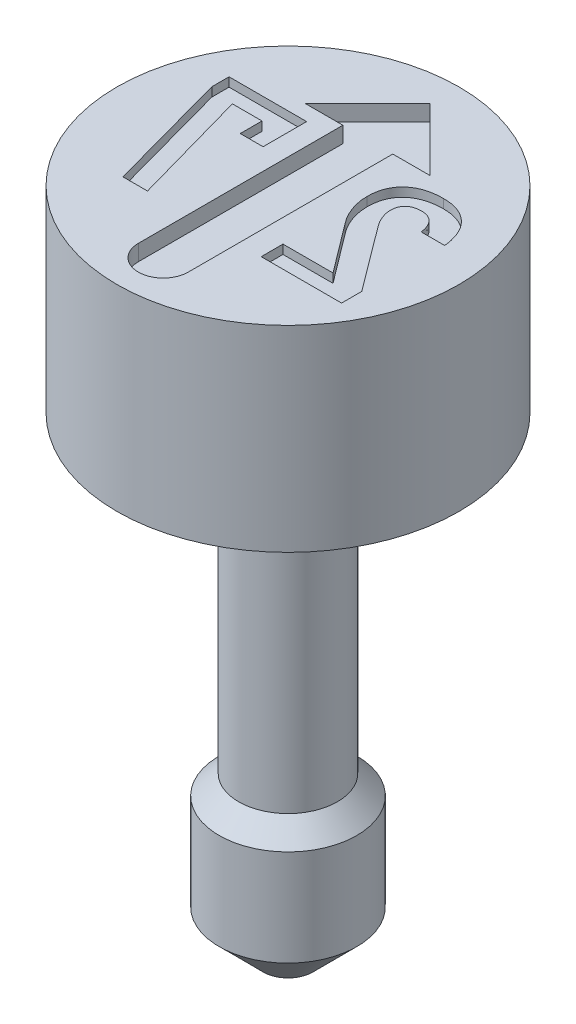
ISO-10303-21;
HEADER;
FILE_DESCRIPTION(('STEP AP214'),'2;1');
FILE_NAME('part.step','',(''),(''),'','','');
FILE_SCHEMA(('AUTOMOTIVE_DESIGN { 1 0 10303 214 1 1 1 1 }'));
ENDSEC;
DATA;
#1=APPLICATION_CONTEXT('core data for automotive mechanical design processes');
#2=APPLICATION_PROTOCOL_DEFINITION('international standard','automotive_design',2000,#1);
#3=PRODUCT_CONTEXT('',#1,'mechanical');
#4=PRODUCT('Part','Part','',(#3));
#5=PRODUCT_RELATED_PRODUCT_CATEGORY('part','',(#4));
#6=PRODUCT_DEFINITION_FORMATION('','',#4);
#7=PRODUCT_DEFINITION_CONTEXT('part definition',#1,'design');
#8=PRODUCT_DEFINITION('design','',#6,#7);
#9=PRODUCT_DEFINITION_SHAPE('','',#8);
#10=(LENGTH_UNIT() NAMED_UNIT(*) SI_UNIT(.MILLI.,.METRE.));
#11=(NAMED_UNIT(*) PLANE_ANGLE_UNIT() SI_UNIT($,.RADIAN.));
#12=(NAMED_UNIT(*) SI_UNIT($,.STERADIAN.) SOLID_ANGLE_UNIT());
#13=UNCERTAINTY_MEASURE_WITH_UNIT(LENGTH_MEASURE(1.E-05),#10,'distance_accuracy_value','');
#14=(GEOMETRIC_REPRESENTATION_CONTEXT(3) GLOBAL_UNCERTAINTY_ASSIGNED_CONTEXT((#13)) GLOBAL_UNIT_ASSIGNED_CONTEXT((#10,
#11,#12)) REPRESENTATION_CONTEXT('',''));
#15=CARTESIAN_POINT('',(0.,0.,0.));
#16=DIRECTION('',(0.,0.,1.));
#17=DIRECTION('',(1.,0.,0.));
#18=AXIS2_PLACEMENT_3D('',#15,#16,#17);
#19=CARTESIAN_POINT('',(0.,17.018,0.));
#20=DIRECTION('',(0.,1.,0.));
#21=DIRECTION('',(0.,0.,1.));
#22=AXIS2_PLACEMENT_3D('',#19,#20,#21);
#23=PLANE('',#22);
#24=DIRECTION('',(1.,0.,0.));
#25=VECTOR('',#24,1.);
#26=CARTESIAN_POINT('',(1.22309659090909,17.018,1.905));
#27=LINE('',#26,#25);
#28=CARTESIAN_POINT('',(1.22309659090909,17.018,1.905));
#29=VERTEX_POINT('',#28);
#30=CARTESIAN_POINT('',(3.26880681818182,17.018,1.905));
#31=VERTEX_POINT('',#30);
#32=EDGE_CURVE('E51',#29,#31,#27,.T.);
#33=ORIENTED_EDGE('',*,*,#32,.F.);
#34=DIRECTION('',(0.,0.,1.));
#35=VECTOR('',#34,1.);
#36=CARTESIAN_POINT('',(1.22309659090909,17.018,1.35081818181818));
#37=LINE('',#36,#35);
#38=CARTESIAN_POINT('',(1.22309659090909,17.018,1.35081818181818));
#39=VERTEX_POINT('',#38);
#40=EDGE_CURVE('E272',#39,#29,#37,.T.);
#41=ORIENTED_EDGE('',*,*,#40,.F.);
#42=DIRECTION('',(-1.,0.,0.));
#43=VECTOR('',#42,1.);
#44=CARTESIAN_POINT('',(2.49670454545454,17.018,1.35081818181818));
#45=LINE('',#44,#43);
#46=CARTESIAN_POINT('',(2.49670454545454,17.018,1.35081818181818));
#47=VERTEX_POINT('',#46);
#48=EDGE_CURVE('E275',#47,#39,#45,.T.);
#49=ORIENTED_EDGE('',*,*,#48,.F.);
#50=DIRECTION('',(0.601464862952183,0.,0.798899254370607));
#51=VECTOR('',#50,1.);
#52=CARTESIAN_POINT('',(1.54925568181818,17.018,0.0923636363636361));
#53=LINE('',#52,#51);
#54=CARTESIAN_POINT('',(1.54925568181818,17.018,0.0923636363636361));
#55=VERTEX_POINT('',#54);
#56=EDGE_CURVE('E587',#55,#47,#53,.T.);
#57=ORIENTED_EDGE('',*,*,#56,.F.);
#58=CARTESIAN_POINT('',(1.24257954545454,17.018,-0.763443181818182));
#59=CARTESIAN_POINT('',(1.24352618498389,17.018,-0.727064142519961));
#60=CARTESIAN_POINT('',(1.24542754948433,17.018,-0.653995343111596));
#61=CARTESIAN_POINT('',(1.26187079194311,17.018,-0.544056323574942));
#62=CARTESIAN_POINT('',(1.28561551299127,17.018,-0.432975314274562));
#63=CARTESIAN_POINT('',(1.32170792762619,17.018,-0.322354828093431));
#64=CARTESIAN_POINT('',(1.36517636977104,17.018,-0.212823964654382));
#65=CARTESIAN_POINT('',(1.41817557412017,17.018,-0.106878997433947));
#66=CARTESIAN_POINT('',(1.47865851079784,17.018,-0.00420610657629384));
#67=CARTESIAN_POINT('',(1.52561230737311,17.018,0.0600219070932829));
#68=CARTESIAN_POINT('',(1.54925568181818,17.018,0.0923636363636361));
#69=B_SPLINE_CURVE_WITH_KNOTS('',3,(#58,#59,#60,#61,#62,#63,#64,#65,#66,#67,#68),.UNSPECIFIED.,
.F.,.F.,(4,1,1,1,1,1,1,1,4),(0.,0.117962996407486,0.236933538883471,0.360005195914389,
0.486119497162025,0.613931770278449,0.74201296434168,0.870091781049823,1.),.UNSPECIFIED.);
#70=CARTESIAN_POINT('',(1.24257954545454,17.018,-0.763443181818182));
#71=VERTEX_POINT('',#70);
#72=EDGE_CURVE('E590',#71,#55,#69,.T.);
#73=ORIENTED_EDGE('',*,*,#72,.F.);
#74=DIRECTION('',(0.,0.,1.));
#75=VECTOR('',#74,1.);
#76=CARTESIAN_POINT('',(1.24257954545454,17.018,-0.765607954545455));
#77=LINE('',#76,#75);
#78=CARTESIAN_POINT('',(1.24257954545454,17.018,-0.765607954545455));
#79=VERTEX_POINT('',#78);
#80=EDGE_CURVE('E595',#79,#71,#77,.T.);
#81=ORIENTED_EDGE('',*,*,#80,.F.);
#82=CARTESIAN_POINT('',(2.26507386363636,17.018,-1.69718181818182));
#83=CARTESIAN_POINT('',(2.22535394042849,17.018,-1.6966033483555));
#84=CARTESIAN_POINT('',(2.14814030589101,17.018,-1.69547883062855));
#85=CARTESIAN_POINT('',(2.03601716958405,17.018,-1.6835133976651));
#86=CARTESIAN_POINT('',(1.93070285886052,17.018,-1.66513761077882));
#87=CARTESIAN_POINT('',(1.83228697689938,17.018,-1.63859915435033));
#88=CARTESIAN_POINT('',(1.74096457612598,17.018,-1.60389107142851));
#89=CARTESIAN_POINT('',(1.65665070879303,17.018,-1.56174591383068));
#90=CARTESIAN_POINT('',(1.57879534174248,17.018,-1.51277898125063));
#91=CARTESIAN_POINT('',(1.50855296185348,17.018,-1.45532995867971));
#92=CARTESIAN_POINT('',(1.44582343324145,17.018,-1.39123849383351));
#93=CARTESIAN_POINT('',(1.39094248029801,17.018,-1.32074097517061));
#94=CARTESIAN_POINT('',(1.3456429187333,17.018,-1.24322787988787));
#95=CARTESIAN_POINT('',(1.30668464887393,17.018,-1.16026173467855));
#96=CARTESIAN_POINT('',(1.27848450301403,17.018,-1.07004074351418));
#97=CARTESIAN_POINT('',(1.25725868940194,17.018,-0.974255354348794));
#98=CARTESIAN_POINT('',(1.24511128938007,17.018,-0.871992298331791));
#99=CARTESIAN_POINT('',(1.24343891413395,17.018,-0.801718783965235));
#100=CARTESIAN_POINT('',(1.24257954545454,17.018,-0.765607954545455));
#101=B_SPLINE_CURVE_WITH_KNOTS('',3,(#82,#83,#84,#85,#86,#87,#88,#89,#90,#91,#92,#93,#94,#95,
#96,#97,#98,#99,#100),.UNSPECIFIED.,.F.,.F.,(4,1,1,1,1,1,1,1,1,1,1,1,1,1,1,1,4),(0.,
0.0757177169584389,0.147191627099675,0.214761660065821,0.279410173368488,0.341256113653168,
0.400743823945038,0.458895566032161,0.516277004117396,0.573364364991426,0.629605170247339,
0.686164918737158,0.744246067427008,0.804009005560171,0.865999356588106,0.931142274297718,1.),.UNSPECIFIED.);
#102=CARTESIAN_POINT('',(2.26507386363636,17.018,-1.69718181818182));
#103=VERTEX_POINT('',#102);
#104=EDGE_CURVE('E601',#103,#79,#101,.T.);
#105=ORIENTED_EDGE('',*,*,#104,.F.);
#106=CARTESIAN_POINT('',(3.31210227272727,17.018,-0.679017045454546));
#107=CARTESIAN_POINT('',(3.30748640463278,17.018,-0.718572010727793));
#108=CARTESIAN_POINT('',(3.29847708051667,17.018,-0.795776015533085));
#109=CARTESIAN_POINT('',(3.27397270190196,17.018,-0.907029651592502));
#110=CARTESIAN_POINT('',(3.24399029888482,17.018,-1.01165308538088));
#111=CARTESIAN_POINT('',(3.2064281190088,17.018,-1.10950868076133));
#112=CARTESIAN_POINT('',(3.16160298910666,17.018,-1.20045566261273));
#113=CARTESIAN_POINT('',(3.11051600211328,17.018,-1.2851667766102));
#114=CARTESIAN_POINT('',(3.05061719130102,17.018,-1.3616068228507));
#115=CARTESIAN_POINT('',(2.98525768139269,17.018,-1.4320592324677));
#116=CARTESIAN_POINT('',(2.91276148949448,17.018,-1.49398033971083));
#117=CARTESIAN_POINT('',(2.83523498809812,17.018,-1.54841886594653));
#118=CARTESIAN_POINT('',(2.75269431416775,17.018,-1.59489573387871));
#119=CARTESIAN_POINT('',(2.66487154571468,17.018,-1.6325910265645));
#120=CARTESIAN_POINT('',(2.57190229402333,17.018,-1.66128536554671));
#121=CARTESIAN_POINT('',(2.47415608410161,17.018,-1.68233882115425));
#122=CARTESIAN_POINT('',(2.37121989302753,17.018,-1.69461810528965));
#123=CARTESIAN_POINT('',(2.30094554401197,17.018,-1.69631542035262));
#124=CARTESIAN_POINT('',(2.26507386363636,17.018,-1.69718181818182));
#125=B_SPLINE_CURVE_WITH_KNOTS('',3,(#106,#107,#108,#109,#110,#111,#112,#113,#114,#115,#116,
#117,#118,#119,#120,#121,#122,#123,#124),.UNSPECIFIED.,.F.,.F.,(4,1,1,1,1,1,1,1,1,1,1,1,1,1,1,1,
4),(0.,0.0735286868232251,0.143514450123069,0.210169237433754,0.274454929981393,
0.336856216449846,0.397291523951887,0.456843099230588,0.515945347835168,0.574554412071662,
0.632618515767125,0.690713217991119,0.749236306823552,0.808827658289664,0.870185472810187,
0.933735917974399,1.),.UNSPECIFIED.);
#126=CARTESIAN_POINT('',(3.31210227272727,17.018,-0.679017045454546));
#127=VERTEX_POINT('',#126);
#128=EDGE_CURVE('E606',#127,#103,#125,.T.);
#129=ORIENTED_EDGE('',*,*,#128,.F.);
#130=DIRECTION('',(0.,0.,-1.));
#131=VECTOR('',#130,1.);
#132=CARTESIAN_POINT('',(3.31210227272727,17.018,-0.676852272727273));
#133=LINE('',#132,#131);
#134=CARTESIAN_POINT('',(3.31210227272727,17.018,-0.676852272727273));
#135=VERTEX_POINT('',#134);
#136=EDGE_CURVE('E614',#135,#127,#133,.T.);
#137=ORIENTED_EDGE('',*,*,#136,.F.);
#138=DIRECTION('',(1.,0.,0.));
#139=VECTOR('',#138,1.);
#140=CARTESIAN_POINT('',(2.71318181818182,17.018,-0.676852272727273));
#141=LINE('',#140,#139);
#142=CARTESIAN_POINT('',(2.71318181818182,17.018,-0.676852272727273));
#143=VERTEX_POINT('',#142);
#144=EDGE_CURVE('E620',#143,#135,#141,.T.);
#145=ORIENTED_EDGE('',*,*,#144,.F.);
#146=DIRECTION('',(0.,0.,1.));
#147=VECTOR('',#146,1.);
#148=CARTESIAN_POINT('',(2.71318181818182,17.018,-0.679017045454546));
#149=LINE('',#148,#147);
#150=CARTESIAN_POINT('',(2.71318181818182,17.018,-0.679017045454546));
#151=VERTEX_POINT('',#150);
#152=EDGE_CURVE('E623',#151,#143,#149,.T.);
#153=ORIENTED_EDGE('',*,*,#152,.F.);
#154=CARTESIAN_POINT('',(2.26002272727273,17.018,-1.143));
#155=CARTESIAN_POINT('',(2.29003159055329,17.018,-1.14188103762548));
#156=CARTESIAN_POINT('',(2.34813862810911,17.018,-1.1397143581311));
#157=CARTESIAN_POINT('',(2.43061784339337,17.018,-1.11523349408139));
#158=CARTESIAN_POINT('',(2.50539350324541,17.018,-1.07762004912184));
#159=CARTESIAN_POINT('',(2.56982588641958,17.018,-1.02326929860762));
#160=CARTESIAN_POINT('',(2.6239797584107,17.018,-0.955521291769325));
#161=CARTESIAN_POINT('',(2.6669086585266,17.018,-0.87490515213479));
#162=CARTESIAN_POINT('',(2.69696365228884,17.018,-0.781190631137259));
#163=CARTESIAN_POINT('',(2.70761500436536,17.018,-0.714087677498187));
#164=CARTESIAN_POINT('',(2.71318181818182,17.018,-0.679017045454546));
#165=B_SPLINE_CURVE_WITH_KNOTS('',3,(#154,#155,#156,#157,#158,#159,#160,#161,#162,#163,#164),
.UNSPECIFIED.,.F.,.F.,(4,1,1,1,1,1,1,1,4),(0.,0.124986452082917,0.242014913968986,
0.356148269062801,0.472436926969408,0.591058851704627,0.716468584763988,0.851815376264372,1.),.UNSPECIFIED.);
#166=CARTESIAN_POINT('',(2.26002272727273,17.018,-1.143));
#167=VERTEX_POINT('',#166);
#168=EDGE_CURVE('E626',#167,#151,#165,.T.);
#169=ORIENTED_EDGE('',*,*,#168,.F.);
#170=CARTESIAN_POINT('',(1.84366477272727,17.018,-0.765607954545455));
#171=CARTESIAN_POINT('',(1.84463766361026,17.018,-0.794145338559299));
#172=CARTESIAN_POINT('',(1.84649815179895,17.018,-0.848718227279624));
#173=CARTESIAN_POINT('',(1.86807762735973,17.018,-0.92510779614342));
#174=CARTESIAN_POINT('',(1.90237876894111,17.018,-0.991575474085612));
#175=CARTESIAN_POINT('',(1.95128974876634,17.018,-1.04657340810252));
#176=CARTESIAN_POINT('',(2.01214366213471,17.018,-1.09034006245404));
#177=CARTESIAN_POINT('',(2.08484861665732,17.018,-1.12191759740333));
#178=CARTESIAN_POINT('',(2.16901394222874,17.018,-1.13931826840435));
#179=CARTESIAN_POINT('',(2.22867406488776,17.018,-1.14173179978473));
#180=CARTESIAN_POINT('',(2.26002272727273,17.018,-1.143));
#181=B_SPLINE_CURVE_WITH_KNOTS('',3,(#170,#171,#172,#173,#174,#175,#176,#177,#178,#179,#180),
.UNSPECIFIED.,.F.,.F.,(4,1,1,1,1,1,1,1,4),(0.,0.133827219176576,0.255921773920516,
0.369738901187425,0.482715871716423,0.598532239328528,0.719553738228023,0.85263833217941,1.),.UNSPECIFIED.);
#182=CARTESIAN_POINT('',(1.84366477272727,17.018,-0.765607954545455));
#183=VERTEX_POINT('',#182);
#184=EDGE_CURVE('E631',#183,#167,#181,.T.);
#185=ORIENTED_EDGE('',*,*,#184,.F.);
#186=DIRECTION('',(0.,0.,-1.));
#187=VECTOR('',#186,1.);
#188=CARTESIAN_POINT('',(1.84366477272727,17.018,-0.760556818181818));
#189=LINE('',#188,#187);
#190=CARTESIAN_POINT('',(1.84366477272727,17.018,-0.760556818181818));
#191=VERTEX_POINT('',#190);
#192=EDGE_CURVE('E639',#191,#183,#189,.T.);
#193=ORIENTED_EDGE('',*,*,#192,.F.);
#194=CARTESIAN_POINT('',(2.04354545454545,17.018,-0.250392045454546));
#195=CARTESIAN_POINT('',(2.02838300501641,17.018,-0.271385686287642));
#196=CARTESIAN_POINT('',(1.99848410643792,17.018,-0.312783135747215));
#197=CARTESIAN_POINT('',(1.9584749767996,17.018,-0.377147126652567));
#198=CARTESIAN_POINT('',(1.92477151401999,17.018,-0.443012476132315));
#199=CARTESIAN_POINT('',(1.89570794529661,17.018,-0.509162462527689));
#200=CARTESIAN_POINT('',(1.87294436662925,17.018,-0.574829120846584));
#201=CARTESIAN_POINT('',(1.85574582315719,17.018,-0.638623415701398));
#202=CARTESIAN_POINT('',(1.84625874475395,17.018,-0.700381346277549));
#203=CARTESIAN_POINT('',(1.84451617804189,17.018,-0.740805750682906));
#204=CARTESIAN_POINT('',(1.84366477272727,17.018,-0.760556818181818));
#205=B_SPLINE_CURVE_WITH_KNOTS('',3,(#194,#195,#196,#197,#198,#199,#200,#201,#202,#203,#204),
.UNSPECIFIED.,.F.,.F.,(4,1,1,1,1,1,1,1,4),(0.,0.139527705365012,0.275135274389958,
0.407888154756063,0.537917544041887,0.66417107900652,0.782063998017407,0.893518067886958,1.),.UNSPECIFIED.);
#206=CARTESIAN_POINT('',(2.04354545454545,17.018,-0.250392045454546));
#207=VERTEX_POINT('',#206);
#208=EDGE_CURVE('E645',#207,#191,#205,.T.);
#209=ORIENTED_EDGE('',*,*,#208,.F.);
#210=DIRECTION('',(-0.597969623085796,0.,-0.801518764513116));
#211=VECTOR('',#210,1.);
#212=CARTESIAN_POINT('',(3.26880681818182,17.018,1.39194886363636));
#213=LINE('',#212,#211);
#214=CARTESIAN_POINT('',(3.26880681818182,17.018,1.39194886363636));
#215=VERTEX_POINT('',#214);
#216=EDGE_CURVE('E650',#215,#207,#213,.T.);
#217=ORIENTED_EDGE('',*,*,#216,.F.);
#218=DIRECTION('',(0.,0.,-1.));
#219=VECTOR('',#218,1.);
#220=CARTESIAN_POINT('',(3.26880681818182,17.018,1.905));
#221=LINE('',#220,#219);
#222=EDGE_CURVE('E656',#31,#215,#221,.T.);
#223=ORIENTED_EDGE('',*,*,#222,.F.);
#224=EDGE_LOOP('',(#33,#41,#49,#57,#73,#81,#105,#129,#137,#145,#153,#169,#185,#193,#209,#217,#223));
#225=FACE_BOUND('',#224,.T.);
#226=DIRECTION('',(-1.,0.,0.));
#227=VECTOR('',#226,1.);
#228=CARTESIAN_POINT('',(-1.17677045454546,17.018,-1.651));
#229=LINE('',#228,#227);
#230=CARTESIAN_POINT('',(-1.17677045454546,17.018,-1.651));
#231=VERTEX_POINT('',#230);
#232=CARTESIAN_POINT('',(-3.15176477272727,17.018,-1.651));
#233=VERTEX_POINT('',#232);
#234=EDGE_CURVE('E59',#231,#233,#229,.T.);
#235=ORIENTED_EDGE('',*,*,#234,.F.);
#236=DIRECTION('',(0.,0.,-1.));
#237=VECTOR('',#236,1.);
#238=CARTESIAN_POINT('',(-1.17677045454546,17.018,-0.542636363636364));
#239=LINE('',#238,#237);
#240=CARTESIAN_POINT('',(-1.17677045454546,17.018,-0.542636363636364));
#241=VERTEX_POINT('',#240);
#242=EDGE_CURVE('E504',#241,#231,#239,.T.);
#243=ORIENTED_EDGE('',*,*,#242,.F.);
#244=DIRECTION('',(1.,0.,0.));
#245=VECTOR('',#244,1.);
#246=CARTESIAN_POINT('',(-1.75837272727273,17.018,-0.542636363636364));
#247=LINE('',#246,#245);
#248=CARTESIAN_POINT('',(-1.75837272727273,17.018,-0.542636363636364));
#249=VERTEX_POINT('',#248);
#250=EDGE_CURVE('E508',#249,#241,#247,.T.);
#251=ORIENTED_EDGE('',*,*,#250,.F.);
#252=DIRECTION('',(0.,0.,1.));
#253=VECTOR('',#252,1.);
#254=CARTESIAN_POINT('',(-1.75837272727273,17.018,-1.09681818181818));
#255=LINE('',#254,#253);
#256=CARTESIAN_POINT('',(-1.75837272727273,17.018,-1.09681818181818));
#257=VERTEX_POINT('',#256);
#258=EDGE_CURVE('E511',#257,#249,#255,.T.);
#259=ORIENTED_EDGE('',*,*,#258,.F.);
#260=DIRECTION('',(1.,0.,0.));
#261=VECTOR('',#260,1.);
#262=CARTESIAN_POINT('',(-2.51315681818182,17.018,-1.09681818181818));
#263=LINE('',#262,#261);
#264=CARTESIAN_POINT('',(-2.51315681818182,17.018,-1.09681818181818));
#265=VERTEX_POINT('',#264);
#266=EDGE_CURVE('E514',#265,#257,#263,.T.);
#267=ORIENTED_EDGE('',*,*,#266,.F.);
#268=DIRECTION('',(-0.270102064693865,0.,-0.962831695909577));
#269=VECTOR('',#268,1.);
#270=CARTESIAN_POINT('',(-1.67106022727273,17.018,1.905));
#271=LINE('',#270,#269);
#272=CARTESIAN_POINT('',(-1.67106022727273,17.018,1.905));
#273=VERTEX_POINT('',#272);
#274=EDGE_CURVE('E517',#273,#265,#271,.T.);
#275=ORIENTED_EDGE('',*,*,#274,.F.);
#276=DIRECTION('',(1.,0.,0.));
#277=VECTOR('',#276,1.);
#278=CARTESIAN_POINT('',(-2.29667954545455,17.018,1.905));
#279=LINE('',#278,#277);
#280=CARTESIAN_POINT('',(-2.29667954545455,17.018,1.905));
#281=VERTEX_POINT('',#280);
#282=EDGE_CURVE('E520',#281,#273,#279,.T.);
#283=ORIENTED_EDGE('',*,*,#282,.F.);
#284=DIRECTION('',(0.264647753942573,0.,0.964345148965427));
#285=VECTOR('',#284,1.);
#286=CARTESIAN_POINT('',(-3.15176477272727,17.018,-1.21082954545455));
#287=LINE('',#286,#285);
#288=CARTESIAN_POINT('',(-3.15176477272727,17.018,-1.21082954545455));
#289=VERTEX_POINT('',#288);
#290=EDGE_CURVE('E523',#289,#281,#287,.T.);
#291=ORIENTED_EDGE('',*,*,#290,.F.);
#292=DIRECTION('',(0.,0.,1.));
#293=VECTOR('',#292,1.);
#294=CARTESIAN_POINT('',(-3.15176477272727,17.018,-1.651));
#295=LINE('',#294,#293);
#296=EDGE_CURVE('E526',#233,#289,#295,.T.);
#297=ORIENTED_EDGE('',*,*,#296,.F.);
#298=EDGE_LOOP('',(#235,#243,#251,#259,#267,#275,#283,#291,#297));
#299=FACE_BOUND('',#298,.T.);
#300=CARTESIAN_POINT('',(0.,17.018,3.175));
#301=DIRECTION('',(0.,1.,0.));
#302=DIRECTION('',(0.,0.,1.));
#303=AXIS2_PLACEMENT_3D('',#300,#301,#302);
#304=CIRCLE('',#303,0.635);
#305=CARTESIAN_POINT('',(-0.635,17.018,3.175));
#306=VERTEX_POINT('',#305);
#307=CARTESIAN_POINT('',(0.635,17.018,3.175));
#308=VERTEX_POINT('',#307);
#309=EDGE_CURVE('E463',#306,#308,#304,.T.);
#310=ORIENTED_EDGE('',*,*,#309,.F.);
#311=DIRECTION('',(0.,0.,1.));
#312=VECTOR('',#311,1.);
#313=CARTESIAN_POINT('',(-0.635,17.018,3.175));
#314=LINE('',#313,#312);
#315=CARTESIAN_POINT('',(-0.635,17.018,-2.032));
#316=VERTEX_POINT('',#315);
#317=EDGE_CURVE('E444',#316,#306,#314,.T.);
#318=ORIENTED_EDGE('',*,*,#317,.F.);
#319=DIRECTION('',(1.,0.,0.));
#320=VECTOR('',#319,1.);
#321=CARTESIAN_POINT('',(-0.635,17.018,-2.032));
#322=LINE('',#321,#320);
#323=CARTESIAN_POINT('',(-1.5875,17.018,-2.032));
#324=VERTEX_POINT('',#323);
#325=EDGE_CURVE('E448',#324,#316,#322,.T.);
#326=ORIENTED_EDGE('',*,*,#325,.F.);
#327=DIRECTION('',(-0.707106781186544,0.,0.707106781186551));
#328=VECTOR('',#327,1.);
#329=CARTESIAN_POINT('',(0.,17.018,-3.61950000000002));
#330=LINE('',#329,#328);
#331=CARTESIAN_POINT('',(0.,17.018,-3.61950000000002));
#332=VERTEX_POINT('',#331);
#333=EDGE_CURVE('E451',#332,#324,#330,.T.);
#334=ORIENTED_EDGE('',*,*,#333,.F.);
#335=DIRECTION('',(-0.707106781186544,0.,-0.707106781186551));
#336=VECTOR('',#335,1.);
#337=CARTESIAN_POINT('',(1.5875,17.018,-2.032));
#338=LINE('',#337,#336);
#339=CARTESIAN_POINT('',(1.5875,17.018,-2.032));
#340=VERTEX_POINT('',#339);
#341=EDGE_CURVE('E454',#340,#332,#338,.T.);
#342=ORIENTED_EDGE('',*,*,#341,.F.);
#343=DIRECTION('',(1.,0.,0.));
#344=VECTOR('',#343,1.);
#345=CARTESIAN_POINT('',(0.635,17.018,-2.032));
#346=LINE('',#345,#344);
#347=CARTESIAN_POINT('',(0.635,17.018,-2.032));
#348=VERTEX_POINT('',#347);
#349=EDGE_CURVE('E457',#348,#340,#346,.T.);
#350=ORIENTED_EDGE('',*,*,#349,.F.);
#351=DIRECTION('',(0.,0.,-1.));
#352=VECTOR('',#351,1.);
#353=CARTESIAN_POINT('',(0.635,17.018,3.175));
#354=LINE('',#353,#352);
#355=EDGE_CURVE('E460',#308,#348,#354,.T.);
#356=ORIENTED_EDGE('',*,*,#355,.F.);
#357=EDGE_LOOP('',(#310,#318,#326,#334,#342,#350,#356));
#358=FACE_BOUND('',#357,.T.);
#359=CARTESIAN_POINT('',(0.,17.018,0.));
#360=DIRECTION('',(0.,-1.,0.));
#361=DIRECTION('',(0.,0.,-1.));
#362=AXIS2_PLACEMENT_3D('',#359,#360,#361);
#363=CIRCLE('',#362,4.3561);
#364=CARTESIAN_POINT('',(0.,17.018,-4.3561));
#365=VERTEX_POINT('',#364);
#366=EDGE_CURVE('E11',#365,#365,#363,.T.);
#367=ORIENTED_EDGE('',*,*,#366,.F.);
#368=EDGE_LOOP('',(#367));
#369=FACE_BOUND('',#368,.T.);
#370=ADVANCED_FACE('F37',(#225,#299,#358,#369),#23,.T.);
#371=CARTESIAN_POINT('',(0.,0.,0.));
#372=DIRECTION('',(0.,-1.,0.));
#373=DIRECTION('',(0.,0.,-1.));
#374=AXIS2_PLACEMENT_3D('',#371,#372,#373);
#375=CYLINDRICAL_SURFACE('',#374,4.3561);
#376=ORIENTED_EDGE('',*,*,#366,.T.);
#377=EDGE_LOOP('',(#376));
#378=FACE_BOUND('',#377,.T.);
#379=CARTESIAN_POINT('',(0.,12.0142,0.));
#380=DIRECTION('',(0.,-1.,0.));
#381=DIRECTION('',(0.,0.,-1.));
#382=AXIS2_PLACEMENT_3D('',#379,#380,#381);
#383=CIRCLE('',#382,4.3561);
#384=CARTESIAN_POINT('',(0.,12.0142,-4.3561));
#385=VERTEX_POINT('',#384);
#386=EDGE_CURVE('E44',#385,#385,#383,.T.);
#387=ORIENTED_EDGE('',*,*,#386,.F.);
#388=EDGE_LOOP('',(#387));
#389=FACE_BOUND('',#388,.T.);
#390=ADVANCED_FACE('F400',(#378,#389),#375,.T.);
#391=CARTESIAN_POINT('',(4.3561,12.0142,0.));
#392=DIRECTION('',(0.,-1.,0.));
#393=DIRECTION('',(0.,0.,-1.));
#394=AXIS2_PLACEMENT_3D('',#391,#392,#393);
#395=PLANE('',#394);
#396=ORIENTED_EDGE('',*,*,#386,.T.);
#397=EDGE_LOOP('',(#396));
#398=FACE_BOUND('',#397,.T.);
#399=CARTESIAN_POINT('',(0.,12.0142,0.));
#400=DIRECTION('',(0.,-1.,0.));
#401=DIRECTION('',(0.,0.,-1.));
#402=AXIS2_PLACEMENT_3D('',#399,#400,#401);
#403=CIRCLE('',#402,1.2573);
#404=CARTESIAN_POINT('',(0.,12.0142,-1.2573));
#405=VERTEX_POINT('',#404);
#406=EDGE_CURVE('E412',#405,#405,#403,.T.);
#407=ORIENTED_EDGE('',*,*,#406,.F.);
#408=EDGE_LOOP('',(#407));
#409=FACE_BOUND('',#408,.T.);
#410=ADVANCED_FACE('F397',(#398,#409),#395,.T.);
#411=CARTESIAN_POINT('',(0.,0.,0.));
#412=DIRECTION('',(0.,-1.,0.));
#413=DIRECTION('',(0.,0.,-1.));
#414=AXIS2_PLACEMENT_3D('',#411,#412,#413);
#415=CYLINDRICAL_SURFACE('',#414,1.2573);
#416=ORIENTED_EDGE('',*,*,#406,.T.);
#417=EDGE_LOOP('',(#416));
#418=FACE_BOUND('',#417,.T.);
#419=CARTESIAN_POINT('',(0.,4.064,0.));
#420=DIRECTION('',(0.,-1.,0.));
#421=DIRECTION('',(0.,0.,-1.));
#422=AXIS2_PLACEMENT_3D('',#419,#420,#421);
#423=CIRCLE('',#422,1.2573);
#424=CARTESIAN_POINT('',(0.,4.064,-1.2573));
#425=VERTEX_POINT('',#424);
#426=EDGE_CURVE('E414',#425,#425,#423,.T.);
#427=ORIENTED_EDGE('',*,*,#426,.F.);
#428=EDGE_LOOP('',(#427));
#429=FACE_BOUND('',#428,.T.);
#430=ADVANCED_FACE('F393',(#418,#429),#415,.T.);
#431=CARTESIAN_POINT('',(0.,3.56870000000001,0.));
#432=DIRECTION('',(0.,-1.,0.));
#433=DIRECTION('',(0.,0.,-1.));
#434=AXIS2_PLACEMENT_3D('',#431,#432,#433);
#435=CONICAL_SURFACE('',#434,1.7526,0.785398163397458);
#436=ORIENTED_EDGE('',*,*,#426,.T.);
#437=EDGE_LOOP('',(#436));
#438=FACE_BOUND('',#437,.T.);
#439=CARTESIAN_POINT('',(0.,3.56870000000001,0.));
#440=DIRECTION('',(0.,-1.,0.));
#441=DIRECTION('',(0.,0.,-1.));
#442=AXIS2_PLACEMENT_3D('',#439,#440,#441);
#443=CIRCLE('',#442,1.7526);
#444=CARTESIAN_POINT('',(0.,3.56870000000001,-1.7526));
#445=VERTEX_POINT('',#444);
#446=EDGE_CURVE('E419',#445,#445,#443,.T.);
#447=ORIENTED_EDGE('',*,*,#446,.F.);
#448=EDGE_LOOP('',(#447));
#449=FACE_BOUND('',#448,.T.);
#450=ADVANCED_FACE('F389',(#438,#449),#435,.T.);
#451=CARTESIAN_POINT('',(0.,0.,0.));
#452=DIRECTION('',(0.,-1.,0.));
#453=DIRECTION('',(0.,0.,-1.));
#454=AXIS2_PLACEMENT_3D('',#451,#452,#453);
#455=CYLINDRICAL_SURFACE('',#454,1.7526);
#456=ORIENTED_EDGE('',*,*,#446,.T.);
#457=EDGE_LOOP('',(#456));
#458=FACE_BOUND('',#457,.T.);
#459=CARTESIAN_POINT('',(0.,1.1176,0.));
#460=DIRECTION('',(0.,-1.,0.));
#461=DIRECTION('',(0.,0.,-1.));
#462=AXIS2_PLACEMENT_3D('',#459,#460,#461);
#463=CIRCLE('',#462,1.7526);
#464=CARTESIAN_POINT('',(0.,1.1176,-1.7526));
#465=VERTEX_POINT('',#464);
#466=EDGE_CURVE('E422',#465,#465,#463,.T.);
#467=ORIENTED_EDGE('',*,*,#466,.F.);
#468=EDGE_LOOP('',(#467));
#469=FACE_BOUND('',#468,.T.);
#470=ADVANCED_FACE('F385',(#458,#469),#455,.T.);
#471=CARTESIAN_POINT('',(0.,0.,0.));
#472=DIRECTION('',(0.,1.,0.));
#473=DIRECTION('',(0.,0.,1.));
#474=AXIS2_PLACEMENT_3D('',#471,#472,#473);
#475=CONICAL_SURFACE('',#474,0.635000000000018,0.78539816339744);
#476=ORIENTED_EDGE('',*,*,#466,.T.);
#477=EDGE_LOOP('',(#476));
#478=FACE_BOUND('',#477,.T.);
#479=CARTESIAN_POINT('',(0.,0.,0.));
#480=DIRECTION('',(0.,-1.,0.));
#481=DIRECTION('',(0.,0.,-1.));
#482=AXIS2_PLACEMENT_3D('',#479,#480,#481);
#483=CIRCLE('',#482,0.635000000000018);
#484=CARTESIAN_POINT('',(0.,0.,-0.635000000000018));
#485=VERTEX_POINT('',#484);
#486=EDGE_CURVE('E425',#485,#485,#483,.T.);
#487=ORIENTED_EDGE('',*,*,#486,.F.);
#488=EDGE_LOOP('',(#487));
#489=FACE_BOUND('',#488,.T.);
#490=ADVANCED_FACE('F381',(#478,#489),#475,.T.);
#491=CARTESIAN_POINT('',(0.635000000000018,0.,0.));
#492=DIRECTION('',(0.,-1.,0.));
#493=DIRECTION('',(0.,0.,-1.));
#494=AXIS2_PLACEMENT_3D('',#491,#492,#493);
#495=PLANE('',#494);
#496=ORIENTED_EDGE('',*,*,#486,.T.);
#497=EDGE_LOOP('',(#496));
#498=FACE_BOUND('',#497,.T.);
#499=ADVANCED_FACE('F377',(#498),#495,.T.);
#500=CARTESIAN_POINT('',(0.,16.6116,3.175));
#501=DIRECTION('',(0.,1.,0.));
#502=DIRECTION('',(0.,0.,1.));
#503=AXIS2_PLACEMENT_3D('',#500,#501,#502);
#504=CYLINDRICAL_SURFACE('',#503,0.635);
#505=ORIENTED_EDGE('',*,*,#309,.T.);
#506=DIRECTION('',(0.,1.,0.));
#507=VECTOR('',#506,1.);
#508=CARTESIAN_POINT('',(0.635,16.6116,3.175));
#509=LINE('',#508,#507);
#510=CARTESIAN_POINT('',(0.635,16.6116,3.175));
#511=VERTEX_POINT('',#510);
#512=EDGE_CURVE('E429',#511,#308,#509,.T.);
#513=ORIENTED_EDGE('',*,*,#512,.F.);
#514=CARTESIAN_POINT('',(0.,16.6116,3.175));
#515=DIRECTION('',(0.,1.,0.));
#516=DIRECTION('',(0.,0.,1.));
#517=AXIS2_PLACEMENT_3D('',#514,#515,#516);
#518=CIRCLE('',#517,0.635);
#519=CARTESIAN_POINT('',(-0.635,16.6116,3.175));
#520=VERTEX_POINT('',#519);
#521=EDGE_CURVE('E447',#520,#511,#518,.T.);
#522=ORIENTED_EDGE('',*,*,#521,.F.);
#523=DIRECTION('',(0.,1.,0.));
#524=VECTOR('',#523,1.);
#525=CARTESIAN_POINT('',(-0.635,16.6116,3.175));
#526=LINE('',#525,#524);
#527=EDGE_CURVE('E428',#520,#306,#526,.T.);
#528=ORIENTED_EDGE('',*,*,#527,.T.);
#529=EDGE_LOOP('',(#505,#513,#522,#528));
#530=FACE_BOUND('',#529,.T.);
#531=ADVANCED_FACE('F355',(#530),#504,.F.);
#532=CARTESIAN_POINT('',(-0.635,16.6116,3.175));
#533=DIRECTION('',(-1.,0.,0.));
#534=DIRECTION('',(0.,0.,1.));
#535=AXIS2_PLACEMENT_3D('',#532,#533,#534);
#536=PLANE('',#535);
#537=ORIENTED_EDGE('',*,*,#317,.T.);
#538=ORIENTED_EDGE('',*,*,#527,.F.);
#539=DIRECTION('',(0.,0.,1.));
#540=VECTOR('',#539,1.);
#541=CARTESIAN_POINT('',(-0.635,16.6116,3.175));
#542=LINE('',#541,#540);
#543=CARTESIAN_POINT('',(-0.635,16.6116,-2.032));
#544=VERTEX_POINT('',#543);
#545=EDGE_CURVE('E433',#544,#520,#542,.T.);
#546=ORIENTED_EDGE('',*,*,#545,.F.);
#547=DIRECTION('',(0.,1.,0.));
#548=VECTOR('',#547,1.);
#549=CARTESIAN_POINT('',(-0.635,16.6116,-2.032));
#550=LINE('',#549,#548);
#551=EDGE_CURVE('E441',#544,#316,#550,.T.);
#552=ORIENTED_EDGE('',*,*,#551,.T.);
#553=EDGE_LOOP('',(#537,#538,#546,#552));
#554=FACE_BOUND('',#553,.T.);
#555=ADVANCED_FACE('F351',(#554),#536,.F.);
#556=CARTESIAN_POINT('',(-0.635,16.6116,-2.032));
#557=DIRECTION('',(0.,0.,1.));
#558=DIRECTION('',(1.,0.,0.));
#559=AXIS2_PLACEMENT_3D('',#556,#557,#558);
#560=PLANE('',#559);
#561=ORIENTED_EDGE('',*,*,#325,.T.);
#562=ORIENTED_EDGE('',*,*,#551,.F.);
#563=DIRECTION('',(1.,0.,0.));
#564=VECTOR('',#563,1.);
#565=CARTESIAN_POINT('',(-0.635,16.6116,-2.032));
#566=LINE('',#565,#564);
#567=CARTESIAN_POINT('',(-1.5875,16.6116,-2.032));
#568=VERTEX_POINT('',#567);
#569=EDGE_CURVE('E468',#568,#544,#566,.T.);
#570=ORIENTED_EDGE('',*,*,#569,.F.);
#571=DIRECTION('',(0.,1.,0.));
#572=VECTOR('',#571,1.);
#573=CARTESIAN_POINT('',(-1.5875,16.6116,-2.032));
#574=LINE('',#573,#572);
#575=EDGE_CURVE('E439',#568,#324,#574,.T.);
#576=ORIENTED_EDGE('',*,*,#575,.T.);
#577=EDGE_LOOP('',(#561,#562,#570,#576));
#578=FACE_BOUND('',#577,.T.);
#579=ADVANCED_FACE('F354',(#578),#560,.F.);
#580=CARTESIAN_POINT('',(0.,16.6116,-3.61950000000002));
#581=DIRECTION('',(-0.707106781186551,0.,-0.707106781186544));
#582=DIRECTION('',(-0.707106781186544,0.,0.707106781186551));
#583=AXIS2_PLACEMENT_3D('',#580,#581,#582);
#584=PLANE('',#583);
#585=ORIENTED_EDGE('',*,*,#333,.T.);
#586=ORIENTED_EDGE('',*,*,#575,.F.);
#587=DIRECTION('',(-0.707106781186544,0.,0.707106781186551));
#588=VECTOR('',#587,1.);
#589=CARTESIAN_POINT('',(0.,16.6116,-3.61950000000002));
#590=LINE('',#589,#588);
#591=CARTESIAN_POINT('',(0.,16.6116,-3.61950000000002));
#592=VERTEX_POINT('',#591);
#593=EDGE_CURVE('E471',#592,#568,#590,.T.);
#594=ORIENTED_EDGE('',*,*,#593,.F.);
#595=DIRECTION('',(0.,1.,0.));
#596=VECTOR('',#595,1.);
#597=CARTESIAN_POINT('',(0.,16.6116,-3.61950000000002));
#598=LINE('',#597,#596);
#599=EDGE_CURVE('E437',#592,#332,#598,.T.);
#600=ORIENTED_EDGE('',*,*,#599,.T.);
#601=EDGE_LOOP('',(#585,#586,#594,#600));
#602=FACE_BOUND('',#601,.T.);
#603=ADVANCED_FACE('F359',(#602),#584,.F.);
#604=CARTESIAN_POINT('',(1.5875,16.6116,-2.032));
#605=DIRECTION('',(0.707106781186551,0.,-0.707106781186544));
#606=DIRECTION('',(-0.707106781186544,0.,-0.707106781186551));
#607=AXIS2_PLACEMENT_3D('',#604,#605,#606);
#608=PLANE('',#607);
#609=ORIENTED_EDGE('',*,*,#341,.T.);
#610=ORIENTED_EDGE('',*,*,#599,.F.);
#611=DIRECTION('',(-0.707106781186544,0.,-0.707106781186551));
#612=VECTOR('',#611,1.);
#613=CARTESIAN_POINT('',(1.5875,16.6116,-2.032));
#614=LINE('',#613,#612);
#615=CARTESIAN_POINT('',(1.5875,16.6116,-2.032));
#616=VERTEX_POINT('',#615);
#617=EDGE_CURVE('E474',#616,#592,#614,.T.);
#618=ORIENTED_EDGE('',*,*,#617,.F.);
#619=DIRECTION('',(0.,1.,0.));
#620=VECTOR('',#619,1.);
#621=CARTESIAN_POINT('',(1.5875,16.6116,-2.032));
#622=LINE('',#621,#620);
#623=EDGE_CURVE('E435',#616,#340,#622,.T.);
#624=ORIENTED_EDGE('',*,*,#623,.T.);
#625=EDGE_LOOP('',(#609,#610,#618,#624));
#626=FACE_BOUND('',#625,.T.);
#627=ADVANCED_FACE('F363',(#626),#608,.F.);
#628=CARTESIAN_POINT('',(0.635,16.6116,-2.032));
#629=DIRECTION('',(0.,0.,1.));
#630=DIRECTION('',(1.,0.,0.));
#631=AXIS2_PLACEMENT_3D('',#628,#629,#630);
#632=PLANE('',#631);
#633=ORIENTED_EDGE('',*,*,#349,.T.);
#634=ORIENTED_EDGE('',*,*,#623,.F.);
#635=DIRECTION('',(1.,0.,0.));
#636=VECTOR('',#635,1.);
#637=CARTESIAN_POINT('',(0.635,16.6116,-2.032));
#638=LINE('',#637,#636);
#639=CARTESIAN_POINT('',(0.635,16.6116,-2.032));
#640=VERTEX_POINT('',#639);
#641=EDGE_CURVE('E477',#640,#616,#638,.T.);
#642=ORIENTED_EDGE('',*,*,#641,.F.);
#643=DIRECTION('',(0.,1.,0.));
#644=VECTOR('',#643,1.);
#645=CARTESIAN_POINT('',(0.635,16.6116,-2.032));
#646=LINE('',#645,#644);
#647=EDGE_CURVE('E432',#640,#348,#646,.T.);
#648=ORIENTED_EDGE('',*,*,#647,.T.);
#649=EDGE_LOOP('',(#633,#634,#642,#648));
#650=FACE_BOUND('',#649,.T.);
#651=ADVANCED_FACE('F367',(#650),#632,.F.);
#652=CARTESIAN_POINT('',(0.635,16.6116,3.175));
#653=DIRECTION('',(1.,0.,0.));
#654=DIRECTION('',(0.,0.,-1.));
#655=AXIS2_PLACEMENT_3D('',#652,#653,#654);
#656=PLANE('',#655);
#657=ORIENTED_EDGE('',*,*,#355,.T.);
#658=ORIENTED_EDGE('',*,*,#647,.F.);
#659=DIRECTION('',(0.,0.,-1.));
#660=VECTOR('',#659,1.);
#661=CARTESIAN_POINT('',(0.635,16.6116,3.175));
#662=LINE('',#661,#660);
#663=EDGE_CURVE('E480',#511,#640,#662,.T.);
#664=ORIENTED_EDGE('',*,*,#663,.F.);
#665=ORIENTED_EDGE('',*,*,#512,.T.);
#666=EDGE_LOOP('',(#657,#658,#664,#665));
#667=FACE_BOUND('',#666,.T.);
#668=ADVANCED_FACE('F349',(#667),#656,.F.);
#669=CARTESIAN_POINT('',(0.,16.6116,3.175));
#670=DIRECTION('',(0.,1.,0.));
#671=DIRECTION('',(0.,0.,1.));
#672=AXIS2_PLACEMENT_3D('',#669,#670,#671);
#673=PLANE('',#672);
#674=ORIENTED_EDGE('',*,*,#521,.T.);
#675=ORIENTED_EDGE('',*,*,#663,.T.);
#676=ORIENTED_EDGE('',*,*,#641,.T.);
#677=ORIENTED_EDGE('',*,*,#617,.T.);
#678=ORIENTED_EDGE('',*,*,#593,.T.);
#679=ORIENTED_EDGE('',*,*,#569,.T.);
#680=ORIENTED_EDGE('',*,*,#545,.T.);
#681=EDGE_LOOP('',(#674,#675,#676,#677,#678,#679,#680));
#682=FACE_BOUND('',#681,.T.);
#683=ADVANCED_FACE('F346',(#682),#673,.T.);
#684=CARTESIAN_POINT('',(-1.17677045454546,16.7894,-1.651));
#685=DIRECTION('',(0.,0.,-1.));
#686=DIRECTION('',(-1.,0.,0.));
#687=AXIS2_PLACEMENT_3D('',#684,#685,#686);
#688=PLANE('',#687);
#689=ORIENTED_EDGE('',*,*,#234,.T.);
#690=DIRECTION('',(0.,1.,0.));
#691=VECTOR('',#690,1.);
#692=CARTESIAN_POINT('',(-3.15176477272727,16.7894,-1.651));
#693=LINE('',#692,#691);
#694=CARTESIAN_POINT('',(-3.15176477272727,16.7894,-1.651));
#695=VERTEX_POINT('',#694);
#696=EDGE_CURVE('E485',#695,#233,#693,.T.);
#697=ORIENTED_EDGE('',*,*,#696,.F.);
#698=DIRECTION('',(-1.,0.,0.));
#699=VECTOR('',#698,1.);
#700=CARTESIAN_POINT('',(-1.17677045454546,16.7894,-1.651));
#701=LINE('',#700,#699);
#702=CARTESIAN_POINT('',(-1.17677045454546,16.7894,-1.651));
#703=VERTEX_POINT('',#702);
#704=EDGE_CURVE('E507',#703,#695,#701,.T.);
#705=ORIENTED_EDGE('',*,*,#704,.F.);
#706=DIRECTION('',(0.,1.,0.));
#707=VECTOR('',#706,1.);
#708=CARTESIAN_POINT('',(-1.17677045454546,16.7894,-1.651));
#709=LINE('',#708,#707);
#710=EDGE_CURVE('E502',#703,#231,#709,.T.);
#711=ORIENTED_EDGE('',*,*,#710,.T.);
#712=EDGE_LOOP('',(#689,#697,#705,#711));
#713=FACE_BOUND('',#712,.T.);
#714=ADVANCED_FACE('F316',(#713),#688,.F.);
#715=CARTESIAN_POINT('',(-1.17677045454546,16.7894,-0.542636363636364));
#716=DIRECTION('',(1.,0.,0.));
#717=DIRECTION('',(0.,0.,-1.));
#718=AXIS2_PLACEMENT_3D('',#715,#716,#717);
#719=PLANE('',#718);
#720=ORIENTED_EDGE('',*,*,#242,.T.);
#721=ORIENTED_EDGE('',*,*,#710,.F.);
#722=DIRECTION('',(0.,0.,-1.));
#723=VECTOR('',#722,1.);
#724=CARTESIAN_POINT('',(-1.17677045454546,16.7894,-0.542636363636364));
#725=LINE('',#724,#723);
#726=CARTESIAN_POINT('',(-1.17677045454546,16.7894,-0.542636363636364));
#727=VERTEX_POINT('',#726);
#728=EDGE_CURVE('E488',#727,#703,#725,.T.);
#729=ORIENTED_EDGE('',*,*,#728,.F.);
#730=DIRECTION('',(0.,1.,0.));
#731=VECTOR('',#730,1.);
#732=CARTESIAN_POINT('',(-1.17677045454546,16.7894,-0.542636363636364));
#733=LINE('',#732,#731);
#734=EDGE_CURVE('E500',#727,#241,#733,.T.);
#735=ORIENTED_EDGE('',*,*,#734,.T.);
#736=EDGE_LOOP('',(#720,#721,#729,#735));
#737=FACE_BOUND('',#736,.T.);
#738=ADVANCED_FACE('F312',(#737),#719,.F.);
#739=CARTESIAN_POINT('',(-1.75837272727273,16.7894,-0.542636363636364));
#740=DIRECTION('',(0.,0.,1.));
#741=DIRECTION('',(1.,0.,0.));
#742=AXIS2_PLACEMENT_3D('',#739,#740,#741);
#743=PLANE('',#742);
#744=ORIENTED_EDGE('',*,*,#250,.T.);
#745=ORIENTED_EDGE('',*,*,#734,.F.);
#746=DIRECTION('',(1.,0.,0.));
#747=VECTOR('',#746,1.);
#748=CARTESIAN_POINT('',(-1.75837272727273,16.7894,-0.542636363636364));
#749=LINE('',#748,#747);
#750=CARTESIAN_POINT('',(-1.75837272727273,16.7894,-0.542636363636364));
#751=VERTEX_POINT('',#750);
#752=EDGE_CURVE('E532',#751,#727,#749,.T.);
#753=ORIENTED_EDGE('',*,*,#752,.F.);
#754=DIRECTION('',(0.,1.,0.));
#755=VECTOR('',#754,1.);
#756=CARTESIAN_POINT('',(-1.75837272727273,16.7894,-0.542636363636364));
#757=LINE('',#756,#755);
#758=EDGE_CURVE('E498',#751,#249,#757,.T.);
#759=ORIENTED_EDGE('',*,*,#758,.T.);
#760=EDGE_LOOP('',(#744,#745,#753,#759));
#761=FACE_BOUND('',#760,.T.);
#762=ADVANCED_FACE('F315',(#761),#743,.F.);
#763=CARTESIAN_POINT('',(-1.75837272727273,16.7894,-1.09681818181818));
#764=DIRECTION('',(-1.,0.,0.));
#765=DIRECTION('',(0.,0.,1.));
#766=AXIS2_PLACEMENT_3D('',#763,#764,#765);
#767=PLANE('',#766);
#768=ORIENTED_EDGE('',*,*,#258,.T.);
#769=ORIENTED_EDGE('',*,*,#758,.F.);
#770=DIRECTION('',(0.,0.,1.));
#771=VECTOR('',#770,1.);
#772=CARTESIAN_POINT('',(-1.75837272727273,16.7894,-1.09681818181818));
#773=LINE('',#772,#771);
#774=CARTESIAN_POINT('',(-1.75837272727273,16.7894,-1.09681818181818));
#775=VERTEX_POINT('',#774);
#776=EDGE_CURVE('E535',#775,#751,#773,.T.);
#777=ORIENTED_EDGE('',*,*,#776,.F.);
#778=DIRECTION('',(0.,1.,0.));
#779=VECTOR('',#778,1.);
#780=CARTESIAN_POINT('',(-1.75837272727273,16.7894,-1.09681818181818));
#781=LINE('',#780,#779);
#782=EDGE_CURVE('E496',#775,#257,#781,.T.);
#783=ORIENTED_EDGE('',*,*,#782,.T.);
#784=EDGE_LOOP('',(#768,#769,#777,#783));
#785=FACE_BOUND('',#784,.T.);
#786=ADVANCED_FACE('F320',(#785),#767,.F.);
#787=CARTESIAN_POINT('',(-2.51315681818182,16.7894,-1.09681818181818));
#788=DIRECTION('',(0.,0.,1.));
#789=DIRECTION('',(1.,0.,0.));
#790=AXIS2_PLACEMENT_3D('',#787,#788,#789);
#791=PLANE('',#790);
#792=ORIENTED_EDGE('',*,*,#266,.T.);
#793=ORIENTED_EDGE('',*,*,#782,.F.);
#794=DIRECTION('',(1.,0.,0.));
#795=VECTOR('',#794,1.);
#796=CARTESIAN_POINT('',(-2.51315681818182,16.7894,-1.09681818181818));
#797=LINE('',#796,#795);
#798=CARTESIAN_POINT('',(-2.51315681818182,16.7894,-1.09681818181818));
#799=VERTEX_POINT('',#798);
#800=EDGE_CURVE('E538',#799,#775,#797,.T.);
#801=ORIENTED_EDGE('',*,*,#800,.F.);
#802=DIRECTION('',(0.,1.,0.));
#803=VECTOR('',#802,1.);
#804=CARTESIAN_POINT('',(-2.51315681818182,16.7894,-1.09681818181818));
#805=LINE('',#804,#803);
#806=EDGE_CURVE('E494',#799,#265,#805,.T.);
#807=ORIENTED_EDGE('',*,*,#806,.T.);
#808=EDGE_LOOP('',(#792,#793,#801,#807));
#809=FACE_BOUND('',#808,.T.);
#810=ADVANCED_FACE('F324',(#809),#791,.F.);
#811=CARTESIAN_POINT('',(-1.67106022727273,16.7894,1.905));
#812=DIRECTION('',(0.962831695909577,0.,-0.270102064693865));
#813=DIRECTION('',(-0.270102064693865,0.,-0.962831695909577));
#814=AXIS2_PLACEMENT_3D('',#811,#812,#813);
#815=PLANE('',#814);
#816=ORIENTED_EDGE('',*,*,#274,.T.);
#817=ORIENTED_EDGE('',*,*,#806,.F.);
#818=DIRECTION('',(-0.270102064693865,0.,-0.962831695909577));
#819=VECTOR('',#818,1.);
#820=CARTESIAN_POINT('',(-1.67106022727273,16.7894,1.905));
#821=LINE('',#820,#819);
#822=CARTESIAN_POINT('',(-1.67106022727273,16.7894,1.905));
#823=VERTEX_POINT('',#822);
#824=EDGE_CURVE('E541',#823,#799,#821,.T.);
#825=ORIENTED_EDGE('',*,*,#824,.F.);
#826=DIRECTION('',(0.,1.,0.));
#827=VECTOR('',#826,1.);
#828=CARTESIAN_POINT('',(-1.67106022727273,16.7894,1.905));
#829=LINE('',#828,#827);
#830=EDGE_CURVE('E492',#823,#273,#829,.T.);
#831=ORIENTED_EDGE('',*,*,#830,.T.);
#832=EDGE_LOOP('',(#816,#817,#825,#831));
#833=FACE_BOUND('',#832,.T.);
#834=ADVANCED_FACE('F328',(#833),#815,.F.);
#835=CARTESIAN_POINT('',(-2.29667954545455,16.7894,1.905));
#836=DIRECTION('',(0.,0.,1.));
#837=DIRECTION('',(1.,0.,0.));
#838=AXIS2_PLACEMENT_3D('',#835,#836,#837);
#839=PLANE('',#838);
#840=ORIENTED_EDGE('',*,*,#282,.T.);
#841=ORIENTED_EDGE('',*,*,#830,.F.);
#842=DIRECTION('',(1.,0.,0.));
#843=VECTOR('',#842,1.);
#844=CARTESIAN_POINT('',(-2.29667954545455,16.7894,1.905));
#845=LINE('',#844,#843);
#846=CARTESIAN_POINT('',(-2.29667954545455,16.7894,1.905));
#847=VERTEX_POINT('',#846);
#848=EDGE_CURVE('E544',#847,#823,#845,.T.);
#849=ORIENTED_EDGE('',*,*,#848,.F.);
#850=DIRECTION('',(0.,1.,0.));
#851=VECTOR('',#850,1.);
#852=CARTESIAN_POINT('',(-2.29667954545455,16.7894,1.905));
#853=LINE('',#852,#851);
#854=EDGE_CURVE('E490',#847,#281,#853,.T.);
#855=ORIENTED_EDGE('',*,*,#854,.T.);
#856=EDGE_LOOP('',(#840,#841,#849,#855));
#857=FACE_BOUND('',#856,.T.);
#858=ADVANCED_FACE('F332',(#857),#839,.F.);
#859=CARTESIAN_POINT('',(-3.15176477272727,16.7894,-1.21082954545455));
#860=DIRECTION('',(-0.964345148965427,0.,0.264647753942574));
#861=DIRECTION('',(0.264647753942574,0.,0.964345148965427));
#862=AXIS2_PLACEMENT_3D('',#859,#860,#861);
#863=PLANE('',#862);
#864=ORIENTED_EDGE('',*,*,#290,.T.);
#865=ORIENTED_EDGE('',*,*,#854,.F.);
#866=DIRECTION('',(0.264647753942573,0.,0.964345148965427));
#867=VECTOR('',#866,1.);
#868=CARTESIAN_POINT('',(-3.15176477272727,16.7894,-1.21082954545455));
#869=LINE('',#868,#867);
#870=CARTESIAN_POINT('',(-3.15176477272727,16.7894,-1.21082954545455));
#871=VERTEX_POINT('',#870);
#872=EDGE_CURVE('E547',#871,#847,#869,.T.);
#873=ORIENTED_EDGE('',*,*,#872,.F.);
#874=DIRECTION('',(0.,1.,0.));
#875=VECTOR('',#874,1.);
#876=CARTESIAN_POINT('',(-3.15176477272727,16.7894,-1.21082954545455));
#877=LINE('',#876,#875);
#878=EDGE_CURVE('E487',#871,#289,#877,.T.);
#879=ORIENTED_EDGE('',*,*,#878,.T.);
#880=EDGE_LOOP('',(#864,#865,#873,#879));
#881=FACE_BOUND('',#880,.T.);
#882=ADVANCED_FACE('F336',(#881),#863,.F.);
#883=CARTESIAN_POINT('',(-3.15176477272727,16.7894,-1.651));
#884=DIRECTION('',(-1.,0.,0.));
#885=DIRECTION('',(0.,0.,1.));
#886=AXIS2_PLACEMENT_3D('',#883,#884,#885);
#887=PLANE('',#886);
#888=ORIENTED_EDGE('',*,*,#296,.T.);
#889=ORIENTED_EDGE('',*,*,#878,.F.);
#890=DIRECTION('',(0.,0.,1.));
#891=VECTOR('',#890,1.);
#892=CARTESIAN_POINT('',(-3.15176477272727,16.7894,-1.651));
#893=LINE('',#892,#891);
#894=EDGE_CURVE('E550',#695,#871,#893,.T.);
#895=ORIENTED_EDGE('',*,*,#894,.F.);
#896=ORIENTED_EDGE('',*,*,#696,.T.);
#897=EDGE_LOOP('',(#888,#889,#895,#896));
#898=FACE_BOUND('',#897,.T.);
#899=ADVANCED_FACE('F310',(#898),#887,.F.);
#900=CARTESIAN_POINT('',(0.,16.7894,0.));
#901=DIRECTION('',(0.,1.,0.));
#902=DIRECTION('',(0.,0.,1.));
#903=AXIS2_PLACEMENT_3D('',#900,#901,#902);
#904=PLANE('',#903);
#905=ORIENTED_EDGE('',*,*,#704,.T.);
#906=ORIENTED_EDGE('',*,*,#894,.T.);
#907=ORIENTED_EDGE('',*,*,#872,.T.);
#908=ORIENTED_EDGE('',*,*,#848,.T.);
#909=ORIENTED_EDGE('',*,*,#824,.T.);
#910=ORIENTED_EDGE('',*,*,#800,.T.);
#911=ORIENTED_EDGE('',*,*,#776,.T.);
#912=ORIENTED_EDGE('',*,*,#752,.T.);
#913=ORIENTED_EDGE('',*,*,#728,.T.);
#914=EDGE_LOOP('',(#905,#906,#907,#908,#909,#910,#911,#912,#913));
#915=FACE_BOUND('',#914,.T.);
#916=ADVANCED_FACE('F307',(#915),#904,.T.);
#917=CARTESIAN_POINT('',(1.22309659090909,16.7894,1.905));
#918=DIRECTION('',(0.,0.,1.));
#919=DIRECTION('',(1.,0.,0.));
#920=AXIS2_PLACEMENT_3D('',#917,#918,#919);
#921=PLANE('',#920);
#922=ORIENTED_EDGE('',*,*,#32,.T.);
#923=DIRECTION('',(0.,1.,0.));
#924=VECTOR('',#923,1.);
#925=CARTESIAN_POINT('',(3.26880681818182,16.7894,1.905));
#926=LINE('',#925,#924);
#927=CARTESIAN_POINT('',(3.26880681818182,16.7894,1.905));
#928=VERTEX_POINT('',#927);
#929=EDGE_CURVE('E249',#928,#31,#926,.T.);
#930=ORIENTED_EDGE('',*,*,#929,.F.);
#931=DIRECTION('',(1.,0.,0.));
#932=VECTOR('',#931,1.);
#933=CARTESIAN_POINT('',(1.22309659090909,16.7894,1.905));
#934=LINE('',#933,#932);
#935=CARTESIAN_POINT('',(1.22309659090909,16.7894,1.905));
#936=VERTEX_POINT('',#935);
#937=EDGE_CURVE('E253',#936,#928,#934,.T.);
#938=ORIENTED_EDGE('',*,*,#937,.F.);
#939=DIRECTION('',(0.,1.,0.));
#940=VECTOR('',#939,1.);
#941=CARTESIAN_POINT('',(1.22309659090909,16.7894,1.905));
#942=LINE('',#941,#940);
#943=EDGE_CURVE('E465',#936,#29,#942,.T.);
#944=ORIENTED_EDGE('',*,*,#943,.T.);
#945=EDGE_LOOP('',(#922,#930,#938,#944));
#946=FACE_BOUND('',#945,.T.);
#947=ADVANCED_FACE('F251',(#946),#921,.F.);
#948=CARTESIAN_POINT('',(1.22309659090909,16.7894,1.35081818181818));
#949=DIRECTION('',(-1.,0.,0.));
#950=DIRECTION('',(0.,0.,1.));
#951=AXIS2_PLACEMENT_3D('',#948,#949,#950);
#952=PLANE('',#951);
#953=ORIENTED_EDGE('',*,*,#40,.T.);
#954=ORIENTED_EDGE('',*,*,#943,.F.);
#955=DIRECTION('',(0.,0.,1.));
#956=VECTOR('',#955,1.);
#957=CARTESIAN_POINT('',(1.22309659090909,16.7894,1.35081818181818));
#958=LINE('',#957,#956);
#959=CARTESIAN_POINT('',(1.22309659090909,16.7894,1.35081818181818));
#960=VERTEX_POINT('',#959);
#961=EDGE_CURVE('E259',#960,#936,#958,.T.);
#962=ORIENTED_EDGE('',*,*,#961,.F.);
#963=DIRECTION('',(0.,1.,0.));
#964=VECTOR('',#963,1.);
#965=CARTESIAN_POINT('',(1.22309659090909,16.7894,1.35081818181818));
#966=LINE('',#965,#964);
#967=EDGE_CURVE('E582',#960,#39,#966,.T.);
#968=ORIENTED_EDGE('',*,*,#967,.T.);
#969=EDGE_LOOP('',(#953,#954,#962,#968));
#970=FACE_BOUND('',#969,.T.);
#971=ADVANCED_FACE('F306',(#970),#952,.F.);
#972=CARTESIAN_POINT('',(2.49670454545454,16.7894,1.35081818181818));
#973=DIRECTION('',(0.,0.,-1.));
#974=DIRECTION('',(-1.,0.,0.));
#975=AXIS2_PLACEMENT_3D('',#972,#973,#974);
#976=PLANE('',#975);
#977=ORIENTED_EDGE('',*,*,#48,.T.);
#978=ORIENTED_EDGE('',*,*,#967,.F.);
#979=DIRECTION('',(-1.,0.,0.));
#980=VECTOR('',#979,1.);
#981=CARTESIAN_POINT('',(2.49670454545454,16.7894,1.35081818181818));
#982=LINE('',#981,#980);
#983=CARTESIAN_POINT('',(2.49670454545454,16.7894,1.35081818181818));
#984=VERTEX_POINT('',#983);
#985=EDGE_CURVE('E660',#984,#960,#982,.T.);
#986=ORIENTED_EDGE('',*,*,#985,.F.);
#987=DIRECTION('',(0.,1.,0.));
#988=VECTOR('',#987,1.);
#989=CARTESIAN_POINT('',(2.49670454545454,16.7894,1.35081818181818));
#990=LINE('',#989,#988);
#991=EDGE_CURVE('E580',#984,#47,#990,.T.);
#992=ORIENTED_EDGE('',*,*,#991,.T.);
#993=EDGE_LOOP('',(#977,#978,#986,#992));
#994=FACE_BOUND('',#993,.T.);
#995=ADVANCED_FACE('F768',(#994),#976,.F.);
#996=CARTESIAN_POINT('',(1.54925568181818,16.7894,0.0923636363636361));
#997=DIRECTION('',(-0.798899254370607,0.,0.601464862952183));
#998=DIRECTION('',(0.601464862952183,0.,0.798899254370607));
#999=AXIS2_PLACEMENT_3D('',#996,#997,#998);
#1000=PLANE('',#999);
#1001=ORIENTED_EDGE('',*,*,#56,.T.);
#1002=ORIENTED_EDGE('',*,*,#991,.F.);
#1003=DIRECTION('',(0.601464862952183,0.,0.798899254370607));
#1004=VECTOR('',#1003,1.);
#1005=CARTESIAN_POINT('',(1.54925568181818,16.7894,0.0923636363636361));
#1006=LINE('',#1005,#1004);
#1007=CARTESIAN_POINT('',(1.54925568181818,16.7894,0.0923636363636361));
#1008=VERTEX_POINT('',#1007);
#1009=EDGE_CURVE('E662',#1008,#984,#1006,.T.);
#1010=ORIENTED_EDGE('',*,*,#1009,.F.);
#1011=DIRECTION('',(0.,1.,0.));
#1012=VECTOR('',#1011,1.);
#1013=CARTESIAN_POINT('',(1.54925568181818,16.7894,0.0923636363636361));
#1014=LINE('',#1013,#1012);
#1015=EDGE_CURVE('E578',#1008,#55,#1014,.T.);
#1016=ORIENTED_EDGE('',*,*,#1015,.T.);
#1017=EDGE_LOOP('',(#1001,#1002,#1010,#1016));
#1018=FACE_BOUND('',#1017,.T.);
#1019=ADVANCED_FACE('F682',(#1018),#1000,.F.);
#1020=CARTESIAN_POINT('',(1.24257954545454,16.7894,-0.763443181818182));
#1021=CARTESIAN_POINT('',(1.24352618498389,16.7894,-0.727064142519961));
#1022=CARTESIAN_POINT('',(1.24542754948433,16.7894,-0.653995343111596));
#1023=CARTESIAN_POINT('',(1.26187079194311,16.7894,-0.544056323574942));
#1024=CARTESIAN_POINT('',(1.28561551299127,16.7894,-0.432975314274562));
#1025=CARTESIAN_POINT('',(1.32170792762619,16.7894,-0.322354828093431));
#1026=CARTESIAN_POINT('',(1.36517636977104,16.7894,-0.212823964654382));
#1027=CARTESIAN_POINT('',(1.41817557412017,16.7894,-0.106878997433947));
#1028=CARTESIAN_POINT('',(1.47865851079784,16.7894,-0.00420610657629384));
#1029=CARTESIAN_POINT('',(1.52561230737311,16.7894,0.0600219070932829));
#1030=CARTESIAN_POINT('',(1.54925568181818,16.7894,0.0923636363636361));
#1031=B_SPLINE_CURVE_WITH_KNOTS('',3,(#1020,#1021,#1022,#1023,#1024,#1025,#1026,#1027,#1028,
#1029,#1030),.UNSPECIFIED.,.F.,.F.,(4,1,1,1,1,1,1,1,4),(0.,0.117962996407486,0.236933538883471,
0.360005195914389,0.486119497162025,0.613931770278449,0.74201296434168,0.870091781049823,1.),.UNSPECIFIED.);
#1032=DIRECTION('',(0.,1.,0.));
#1033=VECTOR('',#1032,1.);
#1034=SURFACE_OF_LINEAR_EXTRUSION('',#1031,#1033);
#1035=ORIENTED_EDGE('',*,*,#72,.T.);
#1036=ORIENTED_EDGE('',*,*,#1015,.F.);
#1037=CARTESIAN_POINT('',(1.24257954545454,16.7894,-0.763443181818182));
#1038=VERTEX_POINT('',#1037);
#1039=EDGE_CURVE('E665',#1038,#1008,#1031,.T.);
#1040=ORIENTED_EDGE('',*,*,#1039,.F.);
#1041=DIRECTION('',(0.,1.,0.));
#1042=VECTOR('',#1041,1.);
#1043=CARTESIAN_POINT('',(1.24257954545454,16.7894,-0.763443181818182));
#1044=LINE('',#1043,#1042);
#1045=EDGE_CURVE('E576',#1038,#71,#1044,.T.);
#1046=ORIENTED_EDGE('',*,*,#1045,.T.);
#1047=EDGE_LOOP('',(#1035,#1036,#1040,#1046));
#1048=FACE_BOUND('',#1047,.T.);
#1049=ADVANCED_FACE('F677',(#1048),#1034,.F.);
#1050=CARTESIAN_POINT('',(1.24257954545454,16.7894,-0.765607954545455));
#1051=DIRECTION('',(-1.,0.,0.));
#1052=DIRECTION('',(0.,0.,1.));
#1053=AXIS2_PLACEMENT_3D('',#1050,#1051,#1052);
#1054=PLANE('',#1053);
#1055=ORIENTED_EDGE('',*,*,#80,.T.);
#1056=ORIENTED_EDGE('',*,*,#1045,.F.);
#1057=DIRECTION('',(0.,0.,1.));
#1058=VECTOR('',#1057,1.);
#1059=CARTESIAN_POINT('',(1.24257954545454,16.7894,-0.765607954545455));
#1060=LINE('',#1059,#1058);
#1061=CARTESIAN_POINT('',(1.24257954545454,16.7894,-0.765607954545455));
#1062=VERTEX_POINT('',#1061);
#1063=EDGE_CURVE('E671',#1062,#1038,#1060,.T.);
#1064=ORIENTED_EDGE('',*,*,#1063,.F.);
#1065=DIRECTION('',(0.,1.,0.));
#1066=VECTOR('',#1065,1.);
#1067=CARTESIAN_POINT('',(1.24257954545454,16.7894,-0.765607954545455));
#1068=LINE('',#1067,#1066);
#1069=EDGE_CURVE('E574',#1062,#79,#1068,.T.);
#1070=ORIENTED_EDGE('',*,*,#1069,.T.);
#1071=EDGE_LOOP('',(#1055,#1056,#1064,#1070));
#1072=FACE_BOUND('',#1071,.T.);
#1073=ADVANCED_FACE('F681',(#1072),#1054,.F.);
#1074=CARTESIAN_POINT('',(2.26507386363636,16.7894,-1.69718181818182));
#1075=CARTESIAN_POINT('',(2.22535394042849,16.7894,-1.6966033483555));
#1076=CARTESIAN_POINT('',(2.14814030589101,16.7894,-1.69547883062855));
#1077=CARTESIAN_POINT('',(2.03601716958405,16.7894,-1.6835133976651));
#1078=CARTESIAN_POINT('',(1.93070285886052,16.7894,-1.66513761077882));
#1079=CARTESIAN_POINT('',(1.83228697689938,16.7894,-1.63859915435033));
#1080=CARTESIAN_POINT('',(1.74096457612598,16.7894,-1.60389107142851));
#1081=CARTESIAN_POINT('',(1.65665070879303,16.7894,-1.56174591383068));
#1082=CARTESIAN_POINT('',(1.57879534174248,16.7894,-1.51277898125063));
#1083=CARTESIAN_POINT('',(1.50855296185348,16.7894,-1.45532995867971));
#1084=CARTESIAN_POINT('',(1.44582343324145,16.7894,-1.39123849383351));
#1085=CARTESIAN_POINT('',(1.39094248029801,16.7894,-1.32074097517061));
#1086=CARTESIAN_POINT('',(1.3456429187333,16.7894,-1.24322787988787));
#1087=CARTESIAN_POINT('',(1.30668464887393,16.7894,-1.16026173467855));
#1088=CARTESIAN_POINT('',(1.27848450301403,16.7894,-1.07004074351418));
#1089=CARTESIAN_POINT('',(1.25725868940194,16.7894,-0.974255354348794));
#1090=CARTESIAN_POINT('',(1.24511128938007,16.7894,-0.871992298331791));
#1091=CARTESIAN_POINT('',(1.24343891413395,16.7894,-0.801718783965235));
#1092=CARTESIAN_POINT('',(1.24257954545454,16.7894,-0.765607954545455));
#1093=B_SPLINE_CURVE_WITH_KNOTS('',3,(#1074,#1075,#1076,#1077,#1078,#1079,#1080,#1081,#1082,
#1083,#1084,#1085,#1086,#1087,#1088,#1089,#1090,#1091,#1092),.UNSPECIFIED.,.F.,.F.,(4,1,1,1,1,1,
1,1,1,1,1,1,1,1,1,1,4),(0.,0.0757177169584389,0.147191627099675,0.214761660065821,
0.279410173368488,0.341256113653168,0.400743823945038,0.458895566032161,0.516277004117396,
0.573364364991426,0.629605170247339,0.686164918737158,0.744246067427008,0.804009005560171,
0.865999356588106,0.931142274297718,1.),.UNSPECIFIED.);
#1094=DIRECTION('',(0.,1.,0.));
#1095=VECTOR('',#1094,1.);
#1096=SURFACE_OF_LINEAR_EXTRUSION('',#1093,#1095);
#1097=ORIENTED_EDGE('',*,*,#104,.T.);
#1098=ORIENTED_EDGE('',*,*,#1069,.F.);
#1099=CARTESIAN_POINT('',(2.26507386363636,16.7894,-1.69718181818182));
#1100=VERTEX_POINT('',#1099);
#1101=EDGE_CURVE('E695',#1100,#1062,#1093,.T.);
#1102=ORIENTED_EDGE('',*,*,#1101,.F.);
#1103=DIRECTION('',(0.,1.,0.));
#1104=VECTOR('',#1103,1.);
#1105=CARTESIAN_POINT('',(2.26507386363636,16.7894,-1.69718181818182));
#1106=LINE('',#1105,#1104);
#1107=EDGE_CURVE('E572',#1100,#103,#1106,.T.);
#1108=ORIENTED_EDGE('',*,*,#1107,.T.);
#1109=EDGE_LOOP('',(#1097,#1098,#1102,#1108));
#1110=FACE_BOUND('',#1109,.T.);
#1111=ADVANCED_FACE('F687',(#1110),#1096,.F.);
#1112=CARTESIAN_POINT('',(3.31210227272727,16.7894,-0.679017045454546));
#1113=CARTESIAN_POINT('',(3.30748640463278,16.7894,-0.718572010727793));
#1114=CARTESIAN_POINT('',(3.29847708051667,16.7894,-0.795776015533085));
#1115=CARTESIAN_POINT('',(3.27397270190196,16.7894,-0.907029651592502));
#1116=CARTESIAN_POINT('',(3.24399029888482,16.7894,-1.01165308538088));
#1117=CARTESIAN_POINT('',(3.2064281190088,16.7894,-1.10950868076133));
#1118=CARTESIAN_POINT('',(3.16160298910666,16.7894,-1.20045566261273));
#1119=CARTESIAN_POINT('',(3.11051600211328,16.7894,-1.2851667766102));
#1120=CARTESIAN_POINT('',(3.05061719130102,16.7894,-1.3616068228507));
#1121=CARTESIAN_POINT('',(2.98525768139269,16.7894,-1.4320592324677));
#1122=CARTESIAN_POINT('',(2.91276148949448,16.7894,-1.49398033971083));
#1123=CARTESIAN_POINT('',(2.83523498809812,16.7894,-1.54841886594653));
#1124=CARTESIAN_POINT('',(2.75269431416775,16.7894,-1.59489573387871));
#1125=CARTESIAN_POINT('',(2.66487154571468,16.7894,-1.6325910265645));
#1126=CARTESIAN_POINT('',(2.57190229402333,16.7894,-1.66128536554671));
#1127=CARTESIAN_POINT('',(2.47415608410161,16.7894,-1.68233882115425));
#1128=CARTESIAN_POINT('',(2.37121989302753,16.7894,-1.69461810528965));
#1129=CARTESIAN_POINT('',(2.30094554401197,16.7894,-1.69631542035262));
#1130=CARTESIAN_POINT('',(2.26507386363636,16.7894,-1.69718181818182));
#1131=B_SPLINE_CURVE_WITH_KNOTS('',3,(#1112,#1113,#1114,#1115,#1116,#1117,#1118,#1119,#1120,
#1121,#1122,#1123,#1124,#1125,#1126,#1127,#1128,#1129,#1130),.UNSPECIFIED.,.F.,.F.,(4,1,1,1,1,1,
1,1,1,1,1,1,1,1,1,1,4),(0.,0.0735286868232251,0.143514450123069,0.210169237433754,
0.274454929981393,0.336856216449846,0.397291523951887,0.456843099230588,0.515945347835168,
0.574554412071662,0.632618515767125,0.690713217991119,0.749236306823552,0.808827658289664,
0.870185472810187,0.933735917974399,1.),.UNSPECIFIED.);
#1132=DIRECTION('',(0.,1.,0.));
#1133=VECTOR('',#1132,1.);
#1134=SURFACE_OF_LINEAR_EXTRUSION('',#1131,#1133);
#1135=ORIENTED_EDGE('',*,*,#128,.T.);
#1136=ORIENTED_EDGE('',*,*,#1107,.F.);
#1137=CARTESIAN_POINT('',(3.31210227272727,16.7894,-0.679017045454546));
#1138=VERTEX_POINT('',#1137);
#1139=EDGE_CURVE('E700',#1138,#1100,#1131,.T.);
#1140=ORIENTED_EDGE('',*,*,#1139,.F.);
#1141=DIRECTION('',(0.,1.,0.));
#1142=VECTOR('',#1141,1.);
#1143=CARTESIAN_POINT('',(3.31210227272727,16.7894,-0.679017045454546));
#1144=LINE('',#1143,#1142);
#1145=EDGE_CURVE('E570',#1138,#127,#1144,.T.);
#1146=ORIENTED_EDGE('',*,*,#1145,.T.);
#1147=EDGE_LOOP('',(#1135,#1136,#1140,#1146));
#1148=FACE_BOUND('',#1147,.T.);
#1149=ADVANCED_FACE('F691',(#1148),#1134,.F.);
#1150=CARTESIAN_POINT('',(3.31210227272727,16.7894,-0.676852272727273));
#1151=DIRECTION('',(1.,0.,0.));
#1152=DIRECTION('',(0.,0.,-1.));
#1153=AXIS2_PLACEMENT_3D('',#1150,#1151,#1152);
#1154=PLANE('',#1153);
#1155=ORIENTED_EDGE('',*,*,#136,.T.);
#1156=ORIENTED_EDGE('',*,*,#1145,.F.);
#1157=DIRECTION('',(0.,0.,-1.));
#1158=VECTOR('',#1157,1.);
#1159=CARTESIAN_POINT('',(3.31210227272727,16.7894,-0.676852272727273));
#1160=LINE('',#1159,#1158);
#1161=CARTESIAN_POINT('',(3.31210227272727,16.7894,-0.676852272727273));
#1162=VERTEX_POINT('',#1161);
#1163=EDGE_CURVE('E709',#1162,#1138,#1160,.T.);
#1164=ORIENTED_EDGE('',*,*,#1163,.F.);
#1165=DIRECTION('',(0.,1.,0.));
#1166=VECTOR('',#1165,1.);
#1167=CARTESIAN_POINT('',(3.31210227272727,16.7894,-0.676852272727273));
#1168=LINE('',#1167,#1166);
#1169=EDGE_CURVE('E568',#1162,#135,#1168,.T.);
#1170=ORIENTED_EDGE('',*,*,#1169,.T.);
#1171=EDGE_LOOP('',(#1155,#1156,#1164,#1170));
#1172=FACE_BOUND('',#1171,.T.);
#1173=ADVANCED_FACE('F784',(#1172),#1154,.F.);
#1174=CARTESIAN_POINT('',(2.71318181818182,16.7894,-0.676852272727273));
#1175=DIRECTION('',(0.,0.,1.));
#1176=DIRECTION('',(1.,0.,0.));
#1177=AXIS2_PLACEMENT_3D('',#1174,#1175,#1176);
#1178=PLANE('',#1177);
#1179=ORIENTED_EDGE('',*,*,#144,.T.);
#1180=ORIENTED_EDGE('',*,*,#1169,.F.);
#1181=DIRECTION('',(1.,0.,0.));
#1182=VECTOR('',#1181,1.);
#1183=CARTESIAN_POINT('',(2.71318181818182,16.7894,-0.676852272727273));
#1184=LINE('',#1183,#1182);
#1185=CARTESIAN_POINT('',(2.71318181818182,16.7894,-0.676852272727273));
#1186=VERTEX_POINT('',#1185);
#1187=EDGE_CURVE('E715',#1186,#1162,#1184,.T.);
#1188=ORIENTED_EDGE('',*,*,#1187,.F.);
#1189=DIRECTION('',(0.,1.,0.));
#1190=VECTOR('',#1189,1.);
#1191=CARTESIAN_POINT('',(2.71318181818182,16.7894,-0.676852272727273));
#1192=LINE('',#1191,#1190);
#1193=EDGE_CURVE('E566',#1186,#143,#1192,.T.);
#1194=ORIENTED_EDGE('',*,*,#1193,.T.);
#1195=EDGE_LOOP('',(#1179,#1180,#1188,#1194));
#1196=FACE_BOUND('',#1195,.T.);
#1197=ADVANCED_FACE('F787',(#1196),#1178,.F.);
#1198=CARTESIAN_POINT('',(2.71318181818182,16.7894,-0.679017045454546));
#1199=DIRECTION('',(-1.,0.,0.));
#1200=DIRECTION('',(0.,0.,1.));
#1201=AXIS2_PLACEMENT_3D('',#1198,#1199,#1200);
#1202=PLANE('',#1201);
#1203=ORIENTED_EDGE('',*,*,#152,.T.);
#1204=ORIENTED_EDGE('',*,*,#1193,.F.);
#1205=DIRECTION('',(0.,0.,1.));
#1206=VECTOR('',#1205,1.);
#1207=CARTESIAN_POINT('',(2.71318181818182,16.7894,-0.679017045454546));
#1208=LINE('',#1207,#1206);
#1209=CARTESIAN_POINT('',(2.71318181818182,16.7894,-0.679017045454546));
#1210=VERTEX_POINT('',#1209);
#1211=EDGE_CURVE('E718',#1210,#1186,#1208,.T.);
#1212=ORIENTED_EDGE('',*,*,#1211,.F.);
#1213=DIRECTION('',(0.,1.,0.));
#1214=VECTOR('',#1213,1.);
#1215=CARTESIAN_POINT('',(2.71318181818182,16.7894,-0.679017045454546));
#1216=LINE('',#1215,#1214);
#1217=EDGE_CURVE('E564',#1210,#151,#1216,.T.);
#1218=ORIENTED_EDGE('',*,*,#1217,.T.);
#1219=EDGE_LOOP('',(#1203,#1204,#1212,#1218));
#1220=FACE_BOUND('',#1219,.T.);
#1221=ADVANCED_FACE('F738',(#1220),#1202,.F.);
#1222=CARTESIAN_POINT('',(2.26002272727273,16.7894,-1.143));
#1223=CARTESIAN_POINT('',(2.29003159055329,16.7894,-1.14188103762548));
#1224=CARTESIAN_POINT('',(2.34813862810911,16.7894,-1.1397143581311));
#1225=CARTESIAN_POINT('',(2.43061784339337,16.7894,-1.11523349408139));
#1226=CARTESIAN_POINT('',(2.50539350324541,16.7894,-1.07762004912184));
#1227=CARTESIAN_POINT('',(2.56982588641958,16.7894,-1.02326929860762));
#1228=CARTESIAN_POINT('',(2.6239797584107,16.7894,-0.955521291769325));
#1229=CARTESIAN_POINT('',(2.6669086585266,16.7894,-0.87490515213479));
#1230=CARTESIAN_POINT('',(2.69696365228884,16.7894,-0.781190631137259));
#1231=CARTESIAN_POINT('',(2.70761500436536,16.7894,-0.714087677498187));
#1232=CARTESIAN_POINT('',(2.71318181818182,16.7894,-0.679017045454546));
#1233=B_SPLINE_CURVE_WITH_KNOTS('',3,(#1222,#1223,#1224,#1225,#1226,#1227,#1228,#1229,#1230,
#1231,#1232),.UNSPECIFIED.,.F.,.F.,(4,1,1,1,1,1,1,1,4),(0.,0.124986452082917,0.242014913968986,
0.356148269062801,0.472436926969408,0.591058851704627,0.716468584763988,0.851815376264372,1.),.UNSPECIFIED.);
#1234=DIRECTION('',(0.,1.,0.));
#1235=VECTOR('',#1234,1.);
#1236=SURFACE_OF_LINEAR_EXTRUSION('',#1233,#1235);
#1237=ORIENTED_EDGE('',*,*,#168,.T.);
#1238=ORIENTED_EDGE('',*,*,#1217,.F.);
#1239=CARTESIAN_POINT('',(2.26002272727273,16.7894,-1.143));
#1240=VERTEX_POINT('',#1239);
#1241=EDGE_CURVE('E721',#1240,#1210,#1233,.T.);
#1242=ORIENTED_EDGE('',*,*,#1241,.F.);
#1243=DIRECTION('',(0.,1.,0.));
#1244=VECTOR('',#1243,1.);
#1245=CARTESIAN_POINT('',(2.26002272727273,16.7894,-1.143));
#1246=LINE('',#1245,#1244);
#1247=EDGE_CURVE('E562',#1240,#167,#1246,.T.);
#1248=ORIENTED_EDGE('',*,*,#1247,.T.);
#1249=EDGE_LOOP('',(#1237,#1238,#1242,#1248));
#1250=FACE_BOUND('',#1249,.T.);
#1251=ADVANCED_FACE('F734',(#1250),#1236,.F.);
#1252=CARTESIAN_POINT('',(1.84366477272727,16.7894,-0.765607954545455));
#1253=CARTESIAN_POINT('',(1.84463766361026,16.7894,-0.794145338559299));
#1254=CARTESIAN_POINT('',(1.84649815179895,16.7894,-0.848718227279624));
#1255=CARTESIAN_POINT('',(1.86807762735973,16.7894,-0.92510779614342));
#1256=CARTESIAN_POINT('',(1.90237876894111,16.7894,-0.991575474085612));
#1257=CARTESIAN_POINT('',(1.95128974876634,16.7894,-1.04657340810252));
#1258=CARTESIAN_POINT('',(2.01214366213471,16.7894,-1.09034006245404));
#1259=CARTESIAN_POINT('',(2.08484861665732,16.7894,-1.12191759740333));
#1260=CARTESIAN_POINT('',(2.16901394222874,16.7894,-1.13931826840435));
#1261=CARTESIAN_POINT('',(2.22867406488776,16.7894,-1.14173179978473));
#1262=CARTESIAN_POINT('',(2.26002272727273,16.7894,-1.143));
#1263=B_SPLINE_CURVE_WITH_KNOTS('',3,(#1252,#1253,#1254,#1255,#1256,#1257,#1258,#1259,#1260,
#1261,#1262),.UNSPECIFIED.,.F.,.F.,(4,1,1,1,1,1,1,1,4),(0.,0.133827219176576,0.255921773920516,
0.369738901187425,0.482715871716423,0.598532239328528,0.719553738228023,0.85263833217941,1.),.UNSPECIFIED.);
#1264=DIRECTION('',(0.,1.,0.));
#1265=VECTOR('',#1264,1.);
#1266=SURFACE_OF_LINEAR_EXTRUSION('',#1263,#1265);
#1267=ORIENTED_EDGE('',*,*,#184,.T.);
#1268=ORIENTED_EDGE('',*,*,#1247,.F.);
#1269=CARTESIAN_POINT('',(1.84366477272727,16.7894,-0.765607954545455));
#1270=VERTEX_POINT('',#1269);
#1271=EDGE_CURVE('E726',#1270,#1240,#1263,.T.);
#1272=ORIENTED_EDGE('',*,*,#1271,.F.);
#1273=DIRECTION('',(0.,1.,0.));
#1274=VECTOR('',#1273,1.);
#1275=CARTESIAN_POINT('',(1.84366477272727,16.7894,-0.765607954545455));
#1276=LINE('',#1275,#1274);
#1277=EDGE_CURVE('E560',#1270,#183,#1276,.T.);
#1278=ORIENTED_EDGE('',*,*,#1277,.T.);
#1279=EDGE_LOOP('',(#1267,#1268,#1272,#1278));
#1280=FACE_BOUND('',#1279,.T.);
#1281=ADVANCED_FACE('F737',(#1280),#1266,.F.);
#1282=CARTESIAN_POINT('',(1.84366477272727,16.7894,-0.760556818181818));
#1283=DIRECTION('',(1.,0.,0.));
#1284=DIRECTION('',(0.,0.,-1.));
#1285=AXIS2_PLACEMENT_3D('',#1282,#1283,#1284);
#1286=PLANE('',#1285);
#1287=ORIENTED_EDGE('',*,*,#192,.T.);
#1288=ORIENTED_EDGE('',*,*,#1277,.F.);
#1289=DIRECTION('',(0.,0.,-1.));
#1290=VECTOR('',#1289,1.);
#1291=CARTESIAN_POINT('',(1.84366477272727,16.7894,-0.760556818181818));
#1292=LINE('',#1291,#1290);
#1293=CARTESIAN_POINT('',(1.84366477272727,16.7894,-0.760556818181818));
#1294=VERTEX_POINT('',#1293);
#1295=EDGE_CURVE('E285',#1294,#1270,#1292,.T.);
#1296=ORIENTED_EDGE('',*,*,#1295,.F.);
#1297=DIRECTION('',(0.,1.,0.));
#1298=VECTOR('',#1297,1.);
#1299=CARTESIAN_POINT('',(1.84366477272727,16.7894,-0.760556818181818));
#1300=LINE('',#1299,#1298);
#1301=EDGE_CURVE('E558',#1294,#191,#1300,.T.);
#1302=ORIENTED_EDGE('',*,*,#1301,.T.);
#1303=EDGE_LOOP('',(#1287,#1288,#1296,#1302));
#1304=FACE_BOUND('',#1303,.T.);
#1305=ADVANCED_FACE('F296',(#1304),#1286,.F.);
#1306=CARTESIAN_POINT('',(2.04354545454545,16.7894,-0.250392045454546));
#1307=CARTESIAN_POINT('',(2.02838300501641,16.7894,-0.271385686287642));
#1308=CARTESIAN_POINT('',(1.99848410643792,16.7894,-0.312783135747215));
#1309=CARTESIAN_POINT('',(1.9584749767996,16.7894,-0.377147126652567));
#1310=CARTESIAN_POINT('',(1.92477151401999,16.7894,-0.443012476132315));
#1311=CARTESIAN_POINT('',(1.89570794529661,16.7894,-0.509162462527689));
#1312=CARTESIAN_POINT('',(1.87294436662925,16.7894,-0.574829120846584));
#1313=CARTESIAN_POINT('',(1.85574582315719,16.7894,-0.638623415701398));
#1314=CARTESIAN_POINT('',(1.84625874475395,16.7894,-0.700381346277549));
#1315=CARTESIAN_POINT('',(1.84451617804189,16.7894,-0.740805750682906));
#1316=CARTESIAN_POINT('',(1.84366477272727,16.7894,-0.760556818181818));
#1317=B_SPLINE_CURVE_WITH_KNOTS('',3,(#1306,#1307,#1308,#1309,#1310,#1311,#1312,#1313,#1314,
#1315,#1316),.UNSPECIFIED.,.F.,.F.,(4,1,1,1,1,1,1,1,4),(0.,0.139527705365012,0.275135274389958,
0.407888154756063,0.537917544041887,0.66417107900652,0.782063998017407,0.893518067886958,1.),.UNSPECIFIED.);
#1318=DIRECTION('',(0.,1.,0.));
#1319=VECTOR('',#1318,1.);
#1320=SURFACE_OF_LINEAR_EXTRUSION('',#1317,#1319);
#1321=ORIENTED_EDGE('',*,*,#208,.T.);
#1322=ORIENTED_EDGE('',*,*,#1301,.F.);
#1323=CARTESIAN_POINT('',(2.04354545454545,16.7894,-0.250392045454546));
#1324=VERTEX_POINT('',#1323);
#1325=EDGE_CURVE('E279',#1324,#1294,#1317,.T.);
#1326=ORIENTED_EDGE('',*,*,#1325,.F.);
#1327=DIRECTION('',(0.,1.,0.));
#1328=VECTOR('',#1327,1.);
#1329=CARTESIAN_POINT('',(2.04354545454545,16.7894,-0.250392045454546));
#1330=LINE('',#1329,#1328);
#1331=EDGE_CURVE('E556',#1324,#207,#1330,.T.);
#1332=ORIENTED_EDGE('',*,*,#1331,.T.);
#1333=EDGE_LOOP('',(#1321,#1322,#1326,#1332));
#1334=FACE_BOUND('',#1333,.T.);
#1335=ADVANCED_FACE('F291',(#1334),#1320,.F.);
#1336=CARTESIAN_POINT('',(3.26880681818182,16.7894,1.39194886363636));
#1337=DIRECTION('',(0.801518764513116,0.,-0.597969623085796));
#1338=DIRECTION('',(-0.597969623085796,0.,-0.801518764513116));
#1339=AXIS2_PLACEMENT_3D('',#1336,#1337,#1338);
#1340=PLANE('',#1339);
#1341=ORIENTED_EDGE('',*,*,#216,.T.);
#1342=ORIENTED_EDGE('',*,*,#1331,.F.);
#1343=DIRECTION('',(-0.597969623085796,0.,-0.801518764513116));
#1344=VECTOR('',#1343,1.);
#1345=CARTESIAN_POINT('',(3.26880681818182,16.7894,1.39194886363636));
#1346=LINE('',#1345,#1344);
#1347=CARTESIAN_POINT('',(3.26880681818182,16.7894,1.39194886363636));
#1348=VERTEX_POINT('',#1347);
#1349=EDGE_CURVE('E267',#1348,#1324,#1346,.T.);
#1350=ORIENTED_EDGE('',*,*,#1349,.F.);
#1351=DIRECTION('',(0.,1.,0.));
#1352=VECTOR('',#1351,1.);
#1353=CARTESIAN_POINT('',(3.26880681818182,16.7894,1.39194886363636));
#1354=LINE('',#1353,#1352);
#1355=EDGE_CURVE('E258',#1348,#215,#1354,.T.);
#1356=ORIENTED_EDGE('',*,*,#1355,.T.);
#1357=EDGE_LOOP('',(#1341,#1342,#1350,#1356));
#1358=FACE_BOUND('',#1357,.T.);
#1359=ADVANCED_FACE('F295',(#1358),#1340,.F.);
#1360=CARTESIAN_POINT('',(3.26880681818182,16.7894,1.905));
#1361=DIRECTION('',(1.,0.,0.));
#1362=DIRECTION('',(0.,0.,-1.));
#1363=AXIS2_PLACEMENT_3D('',#1360,#1361,#1362);
#1364=PLANE('',#1363);
#1365=ORIENTED_EDGE('',*,*,#222,.T.);
#1366=ORIENTED_EDGE('',*,*,#1355,.F.);
#1367=DIRECTION('',(0.,0.,-1.));
#1368=VECTOR('',#1367,1.);
#1369=CARTESIAN_POINT('',(3.26880681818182,16.7894,1.905));
#1370=LINE('',#1369,#1368);
#1371=EDGE_CURVE('E262',#928,#1348,#1370,.T.);
#1372=ORIENTED_EDGE('',*,*,#1371,.F.);
#1373=ORIENTED_EDGE('',*,*,#929,.T.);
#1374=EDGE_LOOP('',(#1365,#1366,#1372,#1373));
#1375=FACE_BOUND('',#1374,.T.);
#1376=ADVANCED_FACE('F263',(#1375),#1364,.F.);
#1377=CARTESIAN_POINT('',(1.90426501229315,16.7894,-0.490598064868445));
#1378=DIRECTION('',(-5.35646013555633E-13,1.,3.86865037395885E-13));
#1379=DIRECTION('',(-1.,-5.35646013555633E-13,0.));
#1380=AXIS2_PLACEMENT_3D('',#1377,#1378,#1379);
#1381=PLANE('',#1380);
#1382=ORIENTED_EDGE('',*,*,#937,.T.);
#1383=ORIENTED_EDGE('',*,*,#1371,.T.);
#1384=ORIENTED_EDGE('',*,*,#1349,.T.);
#1385=ORIENTED_EDGE('',*,*,#1325,.T.);
#1386=ORIENTED_EDGE('',*,*,#1295,.T.);
#1387=ORIENTED_EDGE('',*,*,#1271,.T.);
#1388=ORIENTED_EDGE('',*,*,#1241,.T.);
#1389=ORIENTED_EDGE('',*,*,#1211,.T.);
#1390=ORIENTED_EDGE('',*,*,#1187,.T.);
#1391=ORIENTED_EDGE('',*,*,#1163,.T.);
#1392=ORIENTED_EDGE('',*,*,#1139,.T.);
#1393=ORIENTED_EDGE('',*,*,#1101,.T.);
#1394=ORIENTED_EDGE('',*,*,#1063,.T.);
#1395=ORIENTED_EDGE('',*,*,#1039,.T.);
#1396=ORIENTED_EDGE('',*,*,#1009,.T.);
#1397=ORIENTED_EDGE('',*,*,#985,.T.);
#1398=ORIENTED_EDGE('',*,*,#961,.T.);
#1399=EDGE_LOOP('',(#1382,#1383,#1384,#1385,#1386,#1387,#1388,#1389,#1390,#1391,#1392,#1393,
#1394,#1395,#1396,#1397,#1398));
#1400=FACE_BOUND('',#1399,.T.);
#1401=ADVANCED_FACE('F269',(#1400),#1381,.T.);
#1402=CLOSED_SHELL('',(#370,#390,#410,#430,#450,#470,#490,#499,#531,#555,#579,#603,#627,#651,
#668,#683,#714,#738,#762,#786,#810,#834,#858,#882,#899,#916,#947,#971,#995,#1019,#1049,#1073,
#1111,#1149,#1173,#1197,#1221,#1251,#1281,#1305,#1335,#1359,#1376,#1401));
#1403=MANIFOLD_SOLID_BREP('B2',#1402);
#1404=ADVANCED_BREP_SHAPE_REPRESENTATION('',(#18,#1403),#14);
#1405=SHAPE_DEFINITION_REPRESENTATION(#9,#1404);
ENDSEC;
END-ISO-10303-21;
